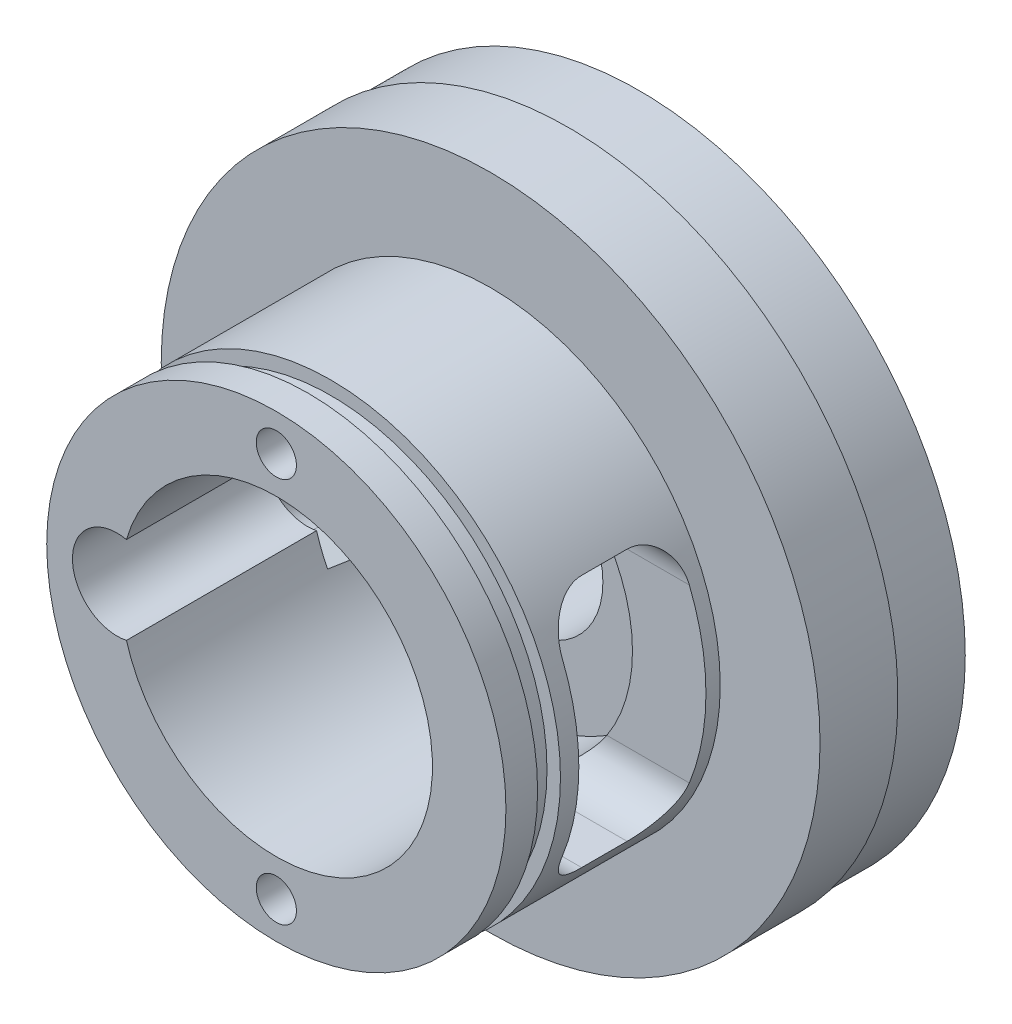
ISO-10303-21;
HEADER;
FILE_DESCRIPTION(('STEP AP214'),'2;1');
FILE_NAME('part.step','',(''),(''),'','','');
FILE_SCHEMA(('AUTOMOTIVE_DESIGN { 1 0 10303 214 1 1 1 1 }'));
ENDSEC;
DATA;
#1=APPLICATION_CONTEXT('core data for automotive mechanical design processes');
#2=APPLICATION_PROTOCOL_DEFINITION('international standard','automotive_design',2000,#1);
#3=PRODUCT_CONTEXT('',#1,'mechanical');
#4=PRODUCT('Part','Part','',(#3));
#5=PRODUCT_RELATED_PRODUCT_CATEGORY('part','',(#4));
#6=PRODUCT_DEFINITION_FORMATION('','',#4);
#7=PRODUCT_DEFINITION_CONTEXT('part definition',#1,'design');
#8=PRODUCT_DEFINITION('design','',#6,#7);
#9=PRODUCT_DEFINITION_SHAPE('','',#8);
#10=(LENGTH_UNIT() NAMED_UNIT(*) SI_UNIT(.MILLI.,.METRE.));
#11=(NAMED_UNIT(*) PLANE_ANGLE_UNIT() SI_UNIT($,.RADIAN.));
#12=(NAMED_UNIT(*) SI_UNIT($,.STERADIAN.) SOLID_ANGLE_UNIT());
#13=UNCERTAINTY_MEASURE_WITH_UNIT(LENGTH_MEASURE(1.E-05),#10,'distance_accuracy_value','');
#14=(GEOMETRIC_REPRESENTATION_CONTEXT(3) GLOBAL_UNCERTAINTY_ASSIGNED_CONTEXT((#13)) GLOBAL_UNIT_ASSIGNED_CONTEXT((#10,
#11,#12)) REPRESENTATION_CONTEXT('',''));
#15=CARTESIAN_POINT('',(0.,0.,0.));
#16=DIRECTION('',(0.,0.,1.));
#17=DIRECTION('',(1.,0.,0.));
#18=AXIS2_PLACEMENT_3D('',#15,#16,#17);
#19=CARTESIAN_POINT('',(-9.906,0.,0.));
#20=DIRECTION('',(0.,0.,1.));
#21=DIRECTION('',(1.,0.,0.));
#22=AXIS2_PLACEMENT_3D('',#19,#20,#21);
#23=CYLINDRICAL_SURFACE('',#22,2.77876);
#24=CARTESIAN_POINT('',(-9.906,0.,16.764));
#25=DIRECTION('',(0.,0.,-1.));
#26=DIRECTION('',(-1.,0.,0.));
#27=AXIS2_PLACEMENT_3D('',#24,#25,#26);
#28=CIRCLE('',#27,2.77876);
#29=CARTESIAN_POINT('',(-12.68476,0.,16.764));
#30=VERTEX_POINT('',#29);
#31=CARTESIAN_POINT('',(-9.32759282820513,2.71789482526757,16.764));
#32=VERTEX_POINT('',#31);
#33=EDGE_CURVE('E184',#30,#32,#28,.T.);
#34=ORIENTED_EDGE('',*,*,#33,.T.);
#35=DIRECTION('',(0.,0.,1.));
#36=VECTOR('',#35,1.);
#37=CARTESIAN_POINT('',(-9.32759282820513,2.71789482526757,14.29766));
#38=LINE('',#37,#36);
#39=CARTESIAN_POINT('',(-9.32759282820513,2.71789482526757,28.59532));
#40=VERTEX_POINT('',#39);
#41=EDGE_CURVE('E197',#40,#32,#38,.F.);
#42=ORIENTED_EDGE('',*,*,#41,.F.);
#43=CARTESIAN_POINT('',(-9.906,0.,28.59532));
#44=DIRECTION('',(0.,0.,1.));
#45=DIRECTION('',(1.,0.,0.));
#46=AXIS2_PLACEMENT_3D('',#43,#44,#45);
#47=CIRCLE('',#46,2.77876);
#48=CARTESIAN_POINT('',(-9.32759282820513,-2.71789482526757,28.59532));
#49=VERTEX_POINT('',#48);
#50=EDGE_CURVE('E208',#40,#49,#47,.T.);
#51=ORIENTED_EDGE('',*,*,#50,.T.);
#52=DIRECTION('',(0.,0.,1.));
#53=VECTOR('',#52,1.);
#54=CARTESIAN_POINT('',(-9.32759282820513,-2.71789482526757,14.29766));
#55=LINE('',#54,#53);
#56=CARTESIAN_POINT('',(-9.32759282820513,-2.71789482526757,16.764));
#57=VERTEX_POINT('',#56);
#58=EDGE_CURVE('E207',#57,#49,#55,.T.);
#59=ORIENTED_EDGE('',*,*,#58,.F.);
#60=EDGE_CURVE('E200',#57,#30,#28,.T.);
#61=ORIENTED_EDGE('',*,*,#60,.T.);
#62=EDGE_LOOP('',(#34,#42,#51,#59,#61));
#63=FACE_BOUND('',#62,.T.);
#64=ADVANCED_FACE('F38',(#63),#23,.F.);
#65=CARTESIAN_POINT('',(0.,0.,28.59532));
#66=DIRECTION('',(0.,0.,-1.));
#67=DIRECTION('',(-1.,0.,0.));
#68=AXIS2_PLACEMENT_3D('',#65,#66,#67);
#69=CYLINDRICAL_SURFACE('',#68,20.4978);
#70=CARTESIAN_POINT('',(0.,0.,15.26032));
#71=DIRECTION('',(0.,0.,1.));
#72=DIRECTION('',(1.,0.,0.));
#73=AXIS2_PLACEMENT_3D('',#70,#71,#72);
#74=CIRCLE('',#73,20.4978);
#75=CARTESIAN_POINT('',(20.4978,0.,15.26032));
#76=VERTEX_POINT('',#75);
#77=EDGE_CURVE('E238',#76,#76,#74,.T.);
#78=ORIENTED_EDGE('',*,*,#77,.F.);
#79=EDGE_LOOP('',(#78));
#80=FACE_BOUND('',#79,.T.);
#81=CARTESIAN_POINT('',(0.,0.,10.414));
#82=DIRECTION('',(0.,0.,-1.));
#83=DIRECTION('',(-1.,0.,0.));
#84=AXIS2_PLACEMENT_3D('',#81,#82,#83);
#85=CIRCLE('',#84,20.4978);
#86=CARTESIAN_POINT('',(-20.4978,0.,10.414));
#87=VERTEX_POINT('',#86);
#88=EDGE_CURVE('E256',#87,#87,#85,.T.);
#89=ORIENTED_EDGE('',*,*,#88,.F.);
#90=EDGE_LOOP('',(#89));
#91=FACE_BOUND('',#90,.T.);
#92=ADVANCED_FACE('F402',(#80,#91),#69,.T.);
#93=CARTESIAN_POINT('',(0.,0.,-58.5562988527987));
#94=DIRECTION('',(0.,0.,1.));
#95=DIRECTION('',(1.,0.,0.));
#96=AXIS2_PLACEMENT_3D('',#93,#94,#95);
#97=CYLINDRICAL_SURFACE('',#96,14.2875);
#98=CARTESIAN_POINT('',(0.,0.,25.20188));
#99=DIRECTION('',(0.,0.,-1.));
#100=DIRECTION('',(-1.,0.,0.));
#101=AXIS2_PLACEMENT_3D('',#98,#99,#100);
#102=CIRCLE('',#101,14.2875);
#103=CARTESIAN_POINT('',(-14.2875,0.,25.20188));
#104=VERTEX_POINT('',#103);
#105=EDGE_CURVE('E219',#104,#104,#102,.T.);
#106=ORIENTED_EDGE('',*,*,#105,.T.);
#107=EDGE_LOOP('',(#106));
#108=FACE_BOUND('',#107,.T.);
#109=CARTESIAN_POINT('',(0.,0.,15.26032));
#110=DIRECTION('',(0.,0.,1.));
#111=DIRECTION('',(1.,0.,0.));
#112=AXIS2_PLACEMENT_3D('',#109,#110,#111);
#113=CIRCLE('',#112,14.2875);
#114=CARTESIAN_POINT('',(14.2875,0.,15.26032));
#115=VERTEX_POINT('',#114);
#116=EDGE_CURVE('E235',#115,#115,#113,.F.);
#117=ORIENTED_EDGE('',*,*,#116,.F.);
#118=EDGE_LOOP('',(#117));
#119=FACE_BOUND('',#118,.T.);
#120=CARTESIAN_POINT('',(0.,0.,16.14932));
#121=DIRECTION('',(0.,0.,-1.));
#122=DIRECTION('',(-1.,0.,0.));
#123=AXIS2_PLACEMENT_3D('',#120,#121,#122);
#124=CIRCLE('',#123,14.2875);
#125=CARTESIAN_POINT('',(13.2544747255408,-5.334,16.14932));
#126=VERTEX_POINT('',#125);
#127=CARTESIAN_POINT('',(13.2544747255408,5.334,16.14932));
#128=VERTEX_POINT('',#127);
#129=EDGE_CURVE('E212',#126,#128,#124,.F.);
#130=ORIENTED_EDGE('',*,*,#129,.F.);
#131=CARTESIAN_POINT('',(13.2544747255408,-5.334,16.14932));
#132=CARTESIAN_POINT('',(13.2228858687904,-5.41250667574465,16.1493233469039));
#133=CARTESIAN_POINT('',(13.1906101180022,-5.4906812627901,16.1529607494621));
#134=CARTESIAN_POINT('',(13.1249338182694,-5.64586992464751,16.1673336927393));
#135=CARTESIAN_POINT('',(13.0915336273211,-5.72288435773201,16.1780669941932));
#136=CARTESIAN_POINT('',(12.9901156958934,-5.95123230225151,16.220606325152));
#137=CARTESIAN_POINT('',(12.9207606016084,-6.10016774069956,16.2627531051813));
#138=CARTESIAN_POINT('',(12.7812086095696,-6.38740222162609,16.3729379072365));
#139=CARTESIAN_POINT('',(12.7110124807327,-6.52571023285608,16.4409538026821));
#140=CARTESIAN_POINT('',(12.5725362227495,-6.78867258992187,16.6014369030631));
#141=CARTESIAN_POINT('',(12.5042577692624,-6.91331525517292,16.6939247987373));
#142=CARTESIAN_POINT('',(12.372384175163,-7.14667455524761,16.9030741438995));
#143=CARTESIAN_POINT('',(12.3088556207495,-7.25518047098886,17.0200142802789));
#144=CARTESIAN_POINT('',(12.1918534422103,-7.45012062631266,17.2753482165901));
#145=CARTESIAN_POINT('',(12.1383637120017,-7.53659030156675,17.4137069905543));
#146=CARTESIAN_POINT('',(12.0579871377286,-7.66432027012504,17.6712876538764));
#147=CARTESIAN_POINT('',(12.0277929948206,-7.71148121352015,17.7865741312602));
#148=CARTESIAN_POINT('',(11.9779313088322,-7.78870670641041,18.024787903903));
#149=CARTESIAN_POINT('',(11.9582412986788,-7.81880775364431,18.1476982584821));
#150=CARTESIAN_POINT('',(11.9371092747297,-7.8510035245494,18.341263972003));
#151=CARTESIAN_POINT('',(11.9314420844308,-7.85960704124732,18.4104494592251));
#152=CARTESIAN_POINT('',(11.9238538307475,-7.87111073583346,18.5495155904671));
#153=CARTESIAN_POINT('',(11.9219338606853,-7.87400924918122,18.6193964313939));
#154=CARTESIAN_POINT('',(11.9219453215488,-7.874,18.68932));
#155=B_SPLINE_CURVE_WITH_KNOTS('',3,(#131,#132,#133,#134,#135,#136,#137,#138,#139,#140,#141,
#142,#143,#144,#145,#146,#147,#148,#149,#150,#151,#152,#153,#154),.UNSPECIFIED.,.F.,.F.,(4,2,2,
2,2,2,2,2,2,2,2,4),(0.,0.253693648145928,0.507307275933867,1.01358523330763,1.51943112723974,
2.02570608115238,2.53810068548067,3.04966605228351,3.43260482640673,3.81472122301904,
4.0242636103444,4.23386712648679),.UNSPECIFIED.);
#156=CARTESIAN_POINT('',(11.9219453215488,-7.874,18.68932));
#157=VERTEX_POINT('',#156);
#158=EDGE_CURVE('E312',#126,#157,#155,.T.);
#159=ORIENTED_EDGE('',*,*,#158,.T.);
#160=DIRECTION('',(0.,0.,1.));
#161=VECTOR('',#160,1.);
#162=CARTESIAN_POINT('',(11.9219453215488,-7.874,-58.5562988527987));
#163=LINE('',#162,#161);
#164=CARTESIAN_POINT('',(11.9219453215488,-7.874,21.51888));
#165=VERTEX_POINT('',#164);
#166=EDGE_CURVE('E378',#157,#165,#163,.T.);
#167=ORIENTED_EDGE('',*,*,#166,.T.);
#168=CARTESIAN_POINT('',(11.9219453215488,-7.874,21.51888));
#169=CARTESIAN_POINT('',(11.9219329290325,-7.87401225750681,21.5827483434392));
#170=CARTESIAN_POINT('',(11.9235359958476,-7.87159143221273,21.64660778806));
#171=CARTESIAN_POINT('',(11.9298789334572,-7.8619784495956,21.7737770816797));
#172=CARTESIAN_POINT('',(11.9346171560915,-7.85478879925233,21.8370872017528));
#173=CARTESIAN_POINT('',(11.9471005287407,-7.83578752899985,21.9623335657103));
#174=CARTESIAN_POINT('',(11.9548282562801,-7.82400268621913,22.0242756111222));
#175=CARTESIAN_POINT('',(11.9731162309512,-7.7959876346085,22.1467062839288));
#176=CARTESIAN_POINT('',(11.9836767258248,-7.77975703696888,22.2071947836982));
#177=CARTESIAN_POINT('',(12.0192612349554,-7.72476108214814,22.3856560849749));
#178=CARTESIAN_POINT('',(12.0482236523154,-7.67963882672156,22.5009632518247));
#179=CARTESIAN_POINT('',(12.1146593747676,-7.57440027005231,22.7218929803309));
#180=CARTESIAN_POINT('',(12.1521441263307,-7.51426379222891,22.8275022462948));
#181=CARTESIAN_POINT('',(12.2366544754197,-7.37590615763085,23.035105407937));
#182=CARTESIAN_POINT('',(12.2841913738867,-7.29665159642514,23.1362005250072));
#183=CARTESIAN_POINT('',(12.3843064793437,-7.125409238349,23.3240479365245));
#184=CARTESIAN_POINT('',(12.4368867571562,-7.03341620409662,23.4107942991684));
#185=CARTESIAN_POINT('',(12.5532914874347,-6.82378033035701,23.5811774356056));
#186=CARTESIAN_POINT('',(12.6176055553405,-6.70436647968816,23.6623084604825));
#187=CARTESIAN_POINT('',(12.7474314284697,-6.45411078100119,23.8030833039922));
#188=CARTESIAN_POINT('',(12.8129434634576,-6.32326672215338,23.8627229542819));
#189=CARTESIAN_POINT('',(12.9431162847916,-6.05235492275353,23.9594312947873));
#190=CARTESIAN_POINT('',(13.0077732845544,-5.91225647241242,23.9964201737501));
#191=CARTESIAN_POINT('',(13.1023561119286,-5.69798764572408,24.0337134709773));
#192=CARTESIAN_POINT('',(13.1335000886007,-5.62583616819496,24.0431130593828));
#193=CARTESIAN_POINT('',(13.1947880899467,-5.48055238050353,24.055695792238));
#194=CARTESIAN_POINT('',(13.2249318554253,-5.40741982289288,24.0588773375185));
#195=CARTESIAN_POINT('',(13.2544747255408,-5.334,24.05888));
#196=B_SPLINE_CURVE_WITH_KNOTS('',3,(#168,#169,#170,#171,#172,#173,#174,#175,#176,#177,#178,
#179,#180,#181,#182,#183,#184,#185,#186,#187,#188,#189,#190,#191,#192,#193,#194,#195),
.UNSPECIFIED.,.F.,.F.,(4,2,2,2,2,2,2,2,2,2,2,2,2,4),(0.,0.191524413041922,0.382948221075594,
0.573272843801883,0.763614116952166,1.14327649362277,1.52345184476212,1.93279032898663,
2.34229761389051,2.81445034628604,3.28669460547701,3.76059341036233,3.99780938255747,
4.23508635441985),.UNSPECIFIED.);
#197=CARTESIAN_POINT('',(13.2544747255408,-5.334,24.05888));
#198=VERTEX_POINT('',#197);
#199=EDGE_CURVE('E280',#165,#198,#196,.T.);
#200=ORIENTED_EDGE('',*,*,#199,.T.);
#201=CARTESIAN_POINT('',(0.,0.,24.05888));
#202=DIRECTION('',(0.,0.,1.));
#203=DIRECTION('',(1.,0.,0.));
#204=AXIS2_PLACEMENT_3D('',#201,#202,#203);
#205=CIRCLE('',#204,14.2875);
#206=CARTESIAN_POINT('',(13.2544747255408,5.334,24.05888));
#207=VERTEX_POINT('',#206);
#208=EDGE_CURVE('E374',#207,#198,#205,.F.);
#209=ORIENTED_EDGE('',*,*,#208,.F.);
#210=CARTESIAN_POINT('',(13.2544747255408,5.334,24.05888));
#211=CARTESIAN_POINT('',(13.2228858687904,5.41250667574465,24.0588766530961));
#212=CARTESIAN_POINT('',(13.1906101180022,5.4906812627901,24.0552392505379));
#213=CARTESIAN_POINT('',(13.1249338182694,5.64586992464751,24.0408663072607));
#214=CARTESIAN_POINT('',(13.0915336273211,5.72288435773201,24.0301330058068));
#215=CARTESIAN_POINT('',(12.9901156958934,5.95123230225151,23.987593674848));
#216=CARTESIAN_POINT('',(12.9207606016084,6.10016774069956,23.9454468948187));
#217=CARTESIAN_POINT('',(12.7812086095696,6.38740222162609,23.8352620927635));
#218=CARTESIAN_POINT('',(12.7110124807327,6.52571023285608,23.7672461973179));
#219=CARTESIAN_POINT('',(12.5725362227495,6.78867258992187,23.6067630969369));
#220=CARTESIAN_POINT('',(12.5042577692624,6.91331525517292,23.5142752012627));
#221=CARTESIAN_POINT('',(12.372384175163,7.14667455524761,23.3051258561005));
#222=CARTESIAN_POINT('',(12.3088556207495,7.25518047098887,23.1881857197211));
#223=CARTESIAN_POINT('',(12.1918534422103,7.45012062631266,22.9328517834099));
#224=CARTESIAN_POINT('',(12.1383637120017,7.53659030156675,22.7944930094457));
#225=CARTESIAN_POINT('',(12.0579871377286,7.66432027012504,22.5369123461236));
#226=CARTESIAN_POINT('',(12.0277929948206,7.71148121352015,22.4216258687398));
#227=CARTESIAN_POINT('',(11.9779313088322,7.78870670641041,22.183412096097));
#228=CARTESIAN_POINT('',(11.9582412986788,7.81880775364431,22.0605017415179));
#229=CARTESIAN_POINT('',(11.9371092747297,7.8510035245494,21.866936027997));
#230=CARTESIAN_POINT('',(11.9314420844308,7.85960704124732,21.7977505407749));
#231=CARTESIAN_POINT('',(11.9238538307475,7.87111073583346,21.6586844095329));
#232=CARTESIAN_POINT('',(11.9219338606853,7.87400924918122,21.5888035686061));
#233=CARTESIAN_POINT('',(11.9219453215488,7.874,21.51888));
#234=B_SPLINE_CURVE_WITH_KNOTS('',3,(#210,#211,#212,#213,#214,#215,#216,#217,#218,#219,#220,
#221,#222,#223,#224,#225,#226,#227,#228,#229,#230,#231,#232,#233),.UNSPECIFIED.,.F.,.F.,(4,2,2,
2,2,2,2,2,2,2,2,4),(0.,0.253693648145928,0.507307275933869,1.01358523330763,1.51943112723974,
2.02570608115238,2.53810068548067,3.04966605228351,3.43260482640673,3.81472122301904,
4.0242636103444,4.23386712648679),.UNSPECIFIED.);
#235=CARTESIAN_POINT('',(11.9219453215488,7.874,21.51888));
#236=VERTEX_POINT('',#235);
#237=EDGE_CURVE('E317',#207,#236,#234,.T.);
#238=ORIENTED_EDGE('',*,*,#237,.T.);
#239=DIRECTION('',(0.,0.,1.));
#240=VECTOR('',#239,1.);
#241=CARTESIAN_POINT('',(11.9219453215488,7.874,-58.5562988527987));
#242=LINE('',#241,#240);
#243=CARTESIAN_POINT('',(11.9219453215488,7.874,18.68932));
#244=VERTEX_POINT('',#243);
#245=EDGE_CURVE('E259',#244,#236,#242,.T.);
#246=ORIENTED_EDGE('',*,*,#245,.F.);
#247=CARTESIAN_POINT('',(11.9219453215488,7.874,18.68932));
#248=CARTESIAN_POINT('',(11.9219329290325,7.87401225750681,18.6254516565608));
#249=CARTESIAN_POINT('',(11.9235359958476,7.87159143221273,18.56159221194));
#250=CARTESIAN_POINT('',(11.9298789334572,7.8619784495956,18.4344229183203));
#251=CARTESIAN_POINT('',(11.9346171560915,7.85478879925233,18.3711127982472));
#252=CARTESIAN_POINT('',(11.9471005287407,7.83578752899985,18.2458664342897));
#253=CARTESIAN_POINT('',(11.9548282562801,7.82400268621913,18.1839243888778));
#254=CARTESIAN_POINT('',(11.9731162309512,7.7959876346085,18.0614937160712));
#255=CARTESIAN_POINT('',(11.9836767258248,7.77975703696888,18.0010052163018));
#256=CARTESIAN_POINT('',(12.0192612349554,7.72476108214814,17.8225439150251));
#257=CARTESIAN_POINT('',(12.0482236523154,7.67963882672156,17.7072367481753));
#258=CARTESIAN_POINT('',(12.1146593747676,7.57440027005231,17.4863070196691));
#259=CARTESIAN_POINT('',(12.1521441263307,7.51426379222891,17.3806977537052));
#260=CARTESIAN_POINT('',(12.2366544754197,7.37590615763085,17.173094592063));
#261=CARTESIAN_POINT('',(12.2841913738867,7.29665159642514,17.0719994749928));
#262=CARTESIAN_POINT('',(12.3843064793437,7.125409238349,16.8841520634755));
#263=CARTESIAN_POINT('',(12.4368867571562,7.03341620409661,16.7974057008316));
#264=CARTESIAN_POINT('',(12.5532914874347,6.82378033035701,16.6270225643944));
#265=CARTESIAN_POINT('',(12.6176055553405,6.70436647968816,16.5458915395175));
#266=CARTESIAN_POINT('',(12.7474314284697,6.45411078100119,16.4051166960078));
#267=CARTESIAN_POINT('',(12.8129434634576,6.32326672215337,16.3454770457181));
#268=CARTESIAN_POINT('',(12.9431162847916,6.05235492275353,16.2487687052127));
#269=CARTESIAN_POINT('',(13.0077732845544,5.91225647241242,16.2117798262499));
#270=CARTESIAN_POINT('',(13.1023561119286,5.69798764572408,16.1744865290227));
#271=CARTESIAN_POINT('',(13.1335000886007,5.62583616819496,16.1650869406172));
#272=CARTESIAN_POINT('',(13.1947880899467,5.48055238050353,16.152504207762));
#273=CARTESIAN_POINT('',(13.2249318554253,5.40741982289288,16.1493226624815));
#274=CARTESIAN_POINT('',(13.2544747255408,5.334,16.14932));
#275=B_SPLINE_CURVE_WITH_KNOTS('',3,(#247,#248,#249,#250,#251,#252,#253,#254,#255,#256,#257,
#258,#259,#260,#261,#262,#263,#264,#265,#266,#267,#268,#269,#270,#271,#272,#273,#274),
.UNSPECIFIED.,.F.,.F.,(4,2,2,2,2,2,2,2,2,2,2,2,2,4),(0.,0.191524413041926,0.382948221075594,
0.573272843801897,0.763614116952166,1.14327649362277,1.52345184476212,1.93279032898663,
2.34229761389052,2.81445034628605,3.28669460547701,3.76059341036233,3.99780938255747,
4.23508635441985),.UNSPECIFIED.);
#276=EDGE_CURVE('E13',#244,#128,#275,.T.);
#277=ORIENTED_EDGE('',*,*,#276,.T.);
#278=EDGE_LOOP('',(#130,#159,#167,#200,#209,#238,#246,#277));
#279=FACE_BOUND('',#278,.T.);
#280=ADVANCED_FACE('F305',(#108,#119,#279),#97,.T.);
#281=CARTESIAN_POINT('',(0.,0.,13.35532));
#282=DIRECTION('',(0.,0.,1.));
#283=DIRECTION('',(1.,0.,0.));
#284=AXIS2_PLACEMENT_3D('',#281,#282,#283);
#285=CYLINDRICAL_SURFACE('',#284,9.7155);
#286=CARTESIAN_POINT('',(0.,0.,16.764));
#287=DIRECTION('',(0.,0.,-1.));
#288=DIRECTION('',(-1.,0.,0.));
#289=AXIS2_PLACEMENT_3D('',#286,#287,#288);
#290=CIRCLE('',#289,9.7155);
#291=CARTESIAN_POINT('',(-8.63903439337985,4.445,16.764));
#292=VERTEX_POINT('',#291);
#293=EDGE_CURVE('E181',#32,#292,#290,.T.);
#294=ORIENTED_EDGE('',*,*,#293,.T.);
#295=CARTESIAN_POINT('',(0.,0.,59.0553499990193));
#296=DIRECTION('',(0.,0.994521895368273,0.104528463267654));
#297=DIRECTION('',(0.,-0.104528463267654,0.994521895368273));
#298=AXIS2_PLACEMENT_3D('',#295,#296,#297);
#299=ELLIPSE('',#298,92.9459756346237,9.7155);
#300=CARTESIAN_POINT('',(-8.44509142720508,4.80326670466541,13.35532));
#301=VERTEX_POINT('',#300);
#302=EDGE_CURVE('E647',#301,#292,#299,.T.);
#303=ORIENTED_EDGE('',*,*,#302,.F.);
#304=CARTESIAN_POINT('',(0.,0.,13.35532));
#305=DIRECTION('',(0.,0.,1.));
#306=DIRECTION('',(1.,0.,0.));
#307=AXIS2_PLACEMENT_3D('',#304,#305,#306);
#308=CIRCLE('',#307,9.7155);
#309=CARTESIAN_POINT('',(-8.44509142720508,-4.8032667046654,13.35532));
#310=VERTEX_POINT('',#309);
#311=EDGE_CURVE('E216',#310,#301,#308,.T.);
#312=ORIENTED_EDGE('',*,*,#311,.F.);
#313=CARTESIAN_POINT('',(0.,0.,59.0553499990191));
#314=DIRECTION('',(0.,-0.994521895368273,0.104528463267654));
#315=DIRECTION('',(0.,0.104528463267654,0.994521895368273));
#316=AXIS2_PLACEMENT_3D('',#313,#314,#315);
#317=ELLIPSE('',#316,92.9459756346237,9.7155);
#318=CARTESIAN_POINT('',(-8.63903439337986,-4.44499999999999,16.764));
#319=VERTEX_POINT('',#318);
#320=EDGE_CURVE('E648',#319,#310,#317,.T.);
#321=ORIENTED_EDGE('',*,*,#320,.F.);
#322=EDGE_CURVE('E193',#319,#57,#290,.T.);
#323=ORIENTED_EDGE('',*,*,#322,.T.);
#324=ORIENTED_EDGE('',*,*,#58,.T.);
#325=CARTESIAN_POINT('',(0.,0.,28.59532));
#326=DIRECTION('',(0.,0.,1.));
#327=DIRECTION('',(1.,0.,0.));
#328=AXIS2_PLACEMENT_3D('',#325,#326,#327);
#329=CIRCLE('',#328,9.7155);
#330=EDGE_CURVE('E206',#49,#40,#329,.T.);
#331=ORIENTED_EDGE('',*,*,#330,.T.);
#332=ORIENTED_EDGE('',*,*,#41,.T.);
#333=EDGE_LOOP('',(#294,#303,#312,#321,#323,#324,#331,#332));
#334=FACE_BOUND('',#333,.T.);
#335=DIRECTION('',(0.,0.,1.));
#336=VECTOR('',#335,1.);
#337=CARTESIAN_POINT('',(5.6913148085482,-7.874,13.35532));
#338=LINE('',#337,#336);
#339=CARTESIAN_POINT('',(5.6913148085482,-7.874,18.68932));
#340=VERTEX_POINT('',#339);
#341=CARTESIAN_POINT('',(5.6913148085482,-7.874,21.51888));
#342=VERTEX_POINT('',#341);
#343=EDGE_CURVE('E252',#340,#342,#338,.T.);
#344=ORIENTED_EDGE('',*,*,#343,.F.);
#345=CARTESIAN_POINT('',(5.6913148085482,-7.874,18.68932));
#346=CARTESIAN_POINT('',(5.69129715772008,-7.87400951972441,18.6440920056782));
#347=CARTESIAN_POINT('',(5.69298559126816,-7.87279230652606,18.598875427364));
#348=CARTESIAN_POINT('',(5.69963789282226,-7.86797931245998,18.5088621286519));
#349=CARTESIAN_POINT('',(5.70459798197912,-7.86438627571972,18.4640649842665));
#350=CARTESIAN_POINT('',(5.71758534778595,-7.85494860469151,18.3756723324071));
#351=CARTESIAN_POINT('',(5.72557815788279,-7.84912926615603,18.3320690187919));
#352=CARTESIAN_POINT('',(5.74440220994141,-7.83536343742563,18.2458207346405));
#353=CARTESIAN_POINT('',(5.75523442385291,-7.827416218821,18.2031760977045));
#354=CARTESIAN_POINT('',(5.79797598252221,-7.79588740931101,18.0549141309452));
#355=CARTESIAN_POINT('',(5.83684974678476,-7.7669359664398,17.9523633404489));
#356=CARTESIAN_POINT('',(5.92661672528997,-7.69865867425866,17.7561010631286));
#357=CARTESIAN_POINT('',(5.97756928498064,-7.65928148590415,17.6624365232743));
#358=CARTESIAN_POINT('',(6.11600780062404,-7.54961080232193,17.4381914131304));
#359=CARTESIAN_POINT('',(6.2087614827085,-7.47385926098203,17.3135643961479));
#360=CARTESIAN_POINT('',(6.40406007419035,-7.30722641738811,17.0836453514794));
#361=CARTESIAN_POINT('',(6.50662521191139,-7.21631355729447,16.9783946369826));
#362=CARTESIAN_POINT('',(6.68179227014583,-7.05364038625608,16.8177342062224));
#363=CARTESIAN_POINT('',(6.75315671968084,-6.98541246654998,16.7573159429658));
#364=CARTESIAN_POINT('',(6.89688886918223,-6.84354325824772,16.6445466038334));
#365=CARTESIAN_POINT('',(6.96925689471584,-6.76990017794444,16.5921982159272));
#366=CARTESIAN_POINT('',(7.18624052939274,-6.54161440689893,16.447510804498));
#367=CARTESIAN_POINT('',(7.33109933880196,-6.37928284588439,16.3672046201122));
#368=CARTESIAN_POINT('',(7.58619924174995,-6.07222260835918,16.2546591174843));
#369=CARTESIAN_POINT('',(7.69745979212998,-5.93068652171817,16.2159474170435));
#370=CARTESIAN_POINT('',(7.85981497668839,-5.71161430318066,16.1764488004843));
#371=CARTESIAN_POINT('',(7.91321409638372,-5.63740656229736,16.166376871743));
#372=CARTESIAN_POINT('',(8.01820467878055,-5.48705553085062,16.1528123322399));
#373=CARTESIAN_POINT('',(8.06979474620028,-5.41091082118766,16.1493246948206));
#374=CARTESIAN_POINT('',(8.12030690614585,-5.334,16.14932));
#375=B_SPLINE_CURVE_WITH_KNOTS('',3,(#345,#346,#347,#348,#349,#350,#351,#352,#353,#354,#355,
#356,#357,#358,#359,#360,#361,#362,#363,#364,#365,#366,#367,#368,#369,#370,#371,#372,#373,#374),
.UNSPECIFIED.,.F.,.F.,(4,2,2,2,2,2,2,2,2,2,2,2,2,2,4),(0.,0.135617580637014,0.271078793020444,
0.405044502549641,0.53905612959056,0.877284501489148,1.21721041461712,1.73289866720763,
2.24967402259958,2.59651823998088,2.94347773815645,3.63564738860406,4.18621681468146,
4.46189723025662,4.73778579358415),.UNSPECIFIED.);
#376=CARTESIAN_POINT('',(8.12030690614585,-5.334,16.14932));
#377=VERTEX_POINT('',#376);
#378=EDGE_CURVE('E337',#340,#377,#375,.T.);
#379=ORIENTED_EDGE('',*,*,#378,.T.);
#380=CARTESIAN_POINT('',(0.,0.,16.14932));
#381=DIRECTION('',(0.,0.,-1.));
#382=DIRECTION('',(-1.,0.,0.));
#383=AXIS2_PLACEMENT_3D('',#380,#381,#382);
#384=CIRCLE('',#383,9.7155);
#385=CARTESIAN_POINT('',(8.12030690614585,5.334,16.14932));
#386=VERTEX_POINT('',#385);
#387=EDGE_CURVE('E249',#377,#386,#384,.F.);
#388=ORIENTED_EDGE('',*,*,#387,.T.);
#389=CARTESIAN_POINT('',(8.12030690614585,5.334,16.14932));
#390=CARTESIAN_POINT('',(8.06088450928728,5.42449211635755,16.1493281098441));
#391=CARTESIAN_POINT('',(7.99995513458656,5.51392458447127,16.1541544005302));
#392=CARTESIAN_POINT('',(7.87567351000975,5.69001116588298,16.1728350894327));
#393=CARTESIAN_POINT('',(7.81232350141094,5.77666771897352,16.1866813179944));
#394=CARTESIAN_POINT('',(7.68380588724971,5.94654578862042,16.2227611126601));
#395=CARTESIAN_POINT('',(7.61864200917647,6.02977358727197,16.2449785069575));
#396=CARTESIAN_POINT('',(7.48693265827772,6.19255740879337,16.2972935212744));
#397=CARTESIAN_POINT('',(7.42038687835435,6.2721126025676,16.327392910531));
#398=CARTESIAN_POINT('',(7.22249267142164,6.50126696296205,16.4273621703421));
#399=CARTESIAN_POINT('',(7.08983348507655,6.64535386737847,16.5077943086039));
#400=CARTESIAN_POINT('',(6.8919827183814,6.8483970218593,16.6484891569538));
#401=CARTESIAN_POINT('',(6.82617169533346,6.9139424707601,16.6987751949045));
#402=CARTESIAN_POINT('',(6.6956306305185,7.0404340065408,16.8060902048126));
#403=CARTESIAN_POINT('',(6.63090034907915,7.10138112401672,16.8631176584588));
#404=CARTESIAN_POINT('',(6.47042329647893,7.2485683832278,17.0152989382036));
#405=CARTESIAN_POINT('',(6.37592461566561,7.33161351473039,17.1149317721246));
#406=CARTESIAN_POINT('',(6.19582465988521,7.48442108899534,17.331096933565));
#407=CARTESIAN_POINT('',(6.11021000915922,7.55420363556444,17.4476032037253));
#408=CARTESIAN_POINT('',(5.98007051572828,7.65730013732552,17.6583711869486));
#409=CARTESIAN_POINT('',(5.93119162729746,7.69512164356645,17.747715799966));
#410=CARTESIAN_POINT('',(5.84434223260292,7.76128684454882,17.9345914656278));
#411=CARTESIAN_POINT('',(5.80632420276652,7.78967192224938,18.0320843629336));
#412=CARTESIAN_POINT('',(5.76227799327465,7.82223572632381,18.1771334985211));
#413=CARTESIAN_POINT('',(5.75029010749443,7.83104540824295,18.2219016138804));
#414=CARTESIAN_POINT('',(5.72942955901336,7.8463203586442,18.3125496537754));
#415=CARTESIAN_POINT('',(5.72055583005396,7.85278642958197,18.3584291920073));
#416=CARTESIAN_POINT('',(5.70611692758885,7.86328530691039,18.4515527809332));
#417=CARTESIAN_POINT('',(5.70059243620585,7.867288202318,18.4988065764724));
#418=CARTESIAN_POINT('',(5.69317802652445,7.87265320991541,18.5938083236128));
#419=CARTESIAN_POINT('',(5.69129294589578,7.87401180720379,18.6415568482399));
#420=CARTESIAN_POINT('',(5.6913148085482,7.874,18.68932));
#421=B_SPLINE_CURVE_WITH_KNOTS('',3,(#389,#390,#391,#392,#393,#394,#395,#396,#397,#398,#399,
#400,#401,#402,#403,#404,#405,#406,#407,#408,#409,#410,#411,#412,#413,#414,#415,#416,#417,#418,
#419,#420),.UNSPECIFIED.,.F.,.F.,(4,2,2,2,2,2,2,2,2,2,2,2,2,2,2,4),(0.,0.324565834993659,
0.648838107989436,0.9724871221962,1.29620884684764,1.92848270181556,2.24510956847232,
2.56166525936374,3.04172076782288,3.52104268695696,3.84602284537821,4.16955841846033,
4.31094218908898,4.45227750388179,4.59529686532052,4.7385062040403),.UNSPECIFIED.);
#422=CARTESIAN_POINT('',(5.6913148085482,7.874,18.68932));
#423=VERTEX_POINT('',#422);
#424=EDGE_CURVE('E48',#386,#423,#421,.T.);
#425=ORIENTED_EDGE('',*,*,#424,.T.);
#426=DIRECTION('',(0.,0.,1.));
#427=VECTOR('',#426,1.);
#428=CARTESIAN_POINT('',(5.6913148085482,7.874,13.35532));
#429=LINE('',#428,#427);
#430=CARTESIAN_POINT('',(5.6913148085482,7.874,21.51888));
#431=VERTEX_POINT('',#430);
#432=EDGE_CURVE('E241',#423,#431,#429,.T.);
#433=ORIENTED_EDGE('',*,*,#432,.T.);
#434=CARTESIAN_POINT('',(5.6913148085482,7.874,21.51888));
#435=CARTESIAN_POINT('',(5.69129715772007,7.87400951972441,21.5641079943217));
#436=CARTESIAN_POINT('',(5.69298559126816,7.87279230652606,21.609324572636));
#437=CARTESIAN_POINT('',(5.69963789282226,7.86797931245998,21.6993378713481));
#438=CARTESIAN_POINT('',(5.70459798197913,7.86438627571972,21.7441350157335));
#439=CARTESIAN_POINT('',(5.71758534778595,7.8549486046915,21.8325276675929));
#440=CARTESIAN_POINT('',(5.72557815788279,7.84912926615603,21.8761309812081));
#441=CARTESIAN_POINT('',(5.74440220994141,7.83536343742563,21.9623792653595));
#442=CARTESIAN_POINT('',(5.75523442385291,7.827416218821,22.0050239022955));
#443=CARTESIAN_POINT('',(5.79797598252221,7.79588740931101,22.1532858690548));
#444=CARTESIAN_POINT('',(5.83684974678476,7.7669359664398,22.2558366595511));
#445=CARTESIAN_POINT('',(5.92661672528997,7.69865867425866,22.4520989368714));
#446=CARTESIAN_POINT('',(5.97756928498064,7.65928148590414,22.5457634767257));
#447=CARTESIAN_POINT('',(6.11600780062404,7.54961080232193,22.7700085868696));
#448=CARTESIAN_POINT('',(6.20876148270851,7.47385926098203,22.8946356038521));
#449=CARTESIAN_POINT('',(6.40406007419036,7.30722641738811,23.1245546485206));
#450=CARTESIAN_POINT('',(6.50662521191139,7.21631355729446,23.2298053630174));
#451=CARTESIAN_POINT('',(6.68179227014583,7.05364038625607,23.3904657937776));
#452=CARTESIAN_POINT('',(6.75315671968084,6.98541246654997,23.4508840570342));
#453=CARTESIAN_POINT('',(6.89688886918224,6.84354325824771,23.5636533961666));
#454=CARTESIAN_POINT('',(6.96925689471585,6.76990017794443,23.6160017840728));
#455=CARTESIAN_POINT('',(7.18624052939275,6.54161440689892,23.760689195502));
#456=CARTESIAN_POINT('',(7.33109933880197,6.37928284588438,23.8409953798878));
#457=CARTESIAN_POINT('',(7.58619924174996,6.07222260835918,23.9535408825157));
#458=CARTESIAN_POINT('',(7.69745979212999,5.93068652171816,23.9922525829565));
#459=CARTESIAN_POINT('',(7.85981497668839,5.71161430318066,24.0317511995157));
#460=CARTESIAN_POINT('',(7.91321409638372,5.63740656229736,24.041823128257));
#461=CARTESIAN_POINT('',(8.01820467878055,5.48705553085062,24.0553876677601));
#462=CARTESIAN_POINT('',(8.06979474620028,5.41091082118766,24.0588753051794));
#463=CARTESIAN_POINT('',(8.12030690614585,5.334,24.05888));
#464=B_SPLINE_CURVE_WITH_KNOTS('',3,(#434,#435,#436,#437,#438,#439,#440,#441,#442,#443,#444,
#445,#446,#447,#448,#449,#450,#451,#452,#453,#454,#455,#456,#457,#458,#459,#460,#461,#462,#463),
.UNSPECIFIED.,.F.,.F.,(4,2,2,2,2,2,2,2,2,2,2,2,2,2,4),(0.,0.135617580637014,0.271078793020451,
0.405044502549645,0.539056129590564,0.877284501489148,1.21721041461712,1.73289866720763,
2.24967402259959,2.5965182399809,2.94347773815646,3.63564738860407,4.18621681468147,
4.46189723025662,4.73778579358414),.UNSPECIFIED.);
#465=CARTESIAN_POINT('',(8.12030690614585,5.334,24.05888));
#466=VERTEX_POINT('',#465);
#467=EDGE_CURVE('E322',#431,#466,#464,.T.);
#468=ORIENTED_EDGE('',*,*,#467,.T.);
#469=CARTESIAN_POINT('',(0.,0.,24.05888));
#470=DIRECTION('',(0.,0.,1.));
#471=DIRECTION('',(1.,0.,0.));
#472=AXIS2_PLACEMENT_3D('',#469,#470,#471);
#473=CIRCLE('',#472,9.7155);
#474=CARTESIAN_POINT('',(8.12030690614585,-5.334,24.05888));
#475=VERTEX_POINT('',#474);
#476=EDGE_CURVE('E246',#466,#475,#473,.F.);
#477=ORIENTED_EDGE('',*,*,#476,.T.);
#478=CARTESIAN_POINT('',(8.12030690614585,-5.334,24.05888));
#479=CARTESIAN_POINT('',(8.06088450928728,-5.42449211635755,24.0588718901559));
#480=CARTESIAN_POINT('',(7.99995513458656,-5.51392458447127,24.0540455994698));
#481=CARTESIAN_POINT('',(7.87567351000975,-5.69001116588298,24.0353649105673));
#482=CARTESIAN_POINT('',(7.81232350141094,-5.77666771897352,24.0215186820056));
#483=CARTESIAN_POINT('',(7.68380588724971,-5.94654578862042,23.9854388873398));
#484=CARTESIAN_POINT('',(7.61864200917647,-6.02977358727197,23.9632214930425));
#485=CARTESIAN_POINT('',(7.48693265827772,-6.19255740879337,23.9109064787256));
#486=CARTESIAN_POINT('',(7.42038687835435,-6.2721126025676,23.880807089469));
#487=CARTESIAN_POINT('',(7.22249267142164,-6.50126696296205,23.7808378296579));
#488=CARTESIAN_POINT('',(7.08983348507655,-6.64535386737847,23.7004056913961));
#489=CARTESIAN_POINT('',(6.8919827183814,-6.8483970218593,23.5597108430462));
#490=CARTESIAN_POINT('',(6.82617169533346,-6.9139424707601,23.5094248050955));
#491=CARTESIAN_POINT('',(6.6956306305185,-7.0404340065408,23.4021097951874));
#492=CARTESIAN_POINT('',(6.63090034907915,-7.10138112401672,23.3450823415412));
#493=CARTESIAN_POINT('',(6.47042329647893,-7.2485683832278,23.1929010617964));
#494=CARTESIAN_POINT('',(6.3759246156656,-7.33161351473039,23.0932682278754));
#495=CARTESIAN_POINT('',(6.19582465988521,-7.48442108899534,22.877103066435));
#496=CARTESIAN_POINT('',(6.11021000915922,-7.55420363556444,22.7605967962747));
#497=CARTESIAN_POINT('',(5.98007051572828,-7.65730013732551,22.5498288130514));
#498=CARTESIAN_POINT('',(5.93119162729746,-7.69512164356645,22.460484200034));
#499=CARTESIAN_POINT('',(5.84434223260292,-7.76128684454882,22.2736085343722));
#500=CARTESIAN_POINT('',(5.80632420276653,-7.78967192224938,22.1761156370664));
#501=CARTESIAN_POINT('',(5.76227799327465,-7.82223572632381,22.0310665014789));
#502=CARTESIAN_POINT('',(5.75029010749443,-7.83104540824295,21.9862983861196));
#503=CARTESIAN_POINT('',(5.72942955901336,-7.8463203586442,21.8956503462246));
#504=CARTESIAN_POINT('',(5.72055583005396,-7.85278642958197,21.8497708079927));
#505=CARTESIAN_POINT('',(5.70611692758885,-7.86328530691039,21.7566472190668));
#506=CARTESIAN_POINT('',(5.70059243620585,-7.867288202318,21.7093934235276));
#507=CARTESIAN_POINT('',(5.69317802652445,-7.87265320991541,21.6143916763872));
#508=CARTESIAN_POINT('',(5.69129294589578,-7.87401180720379,21.5666431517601));
#509=CARTESIAN_POINT('',(5.6913148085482,-7.874,21.51888));
#510=B_SPLINE_CURVE_WITH_KNOTS('',3,(#478,#479,#480,#481,#482,#483,#484,#485,#486,#487,#488,
#489,#490,#491,#492,#493,#494,#495,#496,#497,#498,#499,#500,#501,#502,#503,#504,#505,#506,#507,
#508,#509),.UNSPECIFIED.,.F.,.F.,(4,2,2,2,2,2,2,2,2,2,2,2,2,2,2,4),(0.,0.32456583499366,
0.648838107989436,0.9724871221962,1.29620884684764,1.92848270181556,2.24510956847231,
2.56166525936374,3.04172076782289,3.52104268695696,3.84602284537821,4.16955841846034,
4.31094218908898,4.45227750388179,4.59529686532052,4.7385062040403),.UNSPECIFIED.);
#511=EDGE_CURVE('E287',#475,#342,#510,.T.);
#512=ORIENTED_EDGE('',*,*,#511,.T.);
#513=EDGE_LOOP('',(#344,#379,#388,#425,#433,#468,#477,#512));
#514=FACE_BOUND('',#513,.T.);
#515=ADVANCED_FACE('F203',(#334,#514),#285,.F.);
#516=CARTESIAN_POINT('',(0.,0.,15.26032));
#517=DIRECTION('',(0.,0.,1.));
#518=DIRECTION('',(1.,0.,0.));
#519=AXIS2_PLACEMENT_3D('',#516,#517,#518);
#520=PLANE('',#519);
#521=ORIENTED_EDGE('',*,*,#116,.T.);
#522=EDGE_LOOP('',(#521));
#523=FACE_BOUND('',#522,.T.);
#524=ORIENTED_EDGE('',*,*,#77,.T.);
#525=EDGE_LOOP('',(#524));
#526=FACE_BOUND('',#525,.T.);
#527=ADVANCED_FACE('F306',(#523,#526),#520,.T.);
#528=CARTESIAN_POINT('',(14.2875,0.,26.62428));
#529=DIRECTION('',(0.,0.,-1.));
#530=DIRECTION('',(-1.,0.,0.));
#531=AXIS2_PLACEMENT_3D('',#528,#529,#530);
#532=PLANE('',#531);
#533=CARTESIAN_POINT('',(0.,0.,26.62428));
#534=DIRECTION('',(0.,0.,-1.));
#535=DIRECTION('',(-1.,0.,0.));
#536=AXIS2_PLACEMENT_3D('',#533,#534,#535);
#537=CIRCLE('',#536,14.2875);
#538=CARTESIAN_POINT('',(14.2875,0.,26.62428));
#539=VERTEX_POINT('',#538);
#540=EDGE_CURVE('E229',#539,#539,#537,.T.);
#541=ORIENTED_EDGE('',*,*,#540,.T.);
#542=EDGE_LOOP('',(#541));
#543=FACE_BOUND('',#542,.T.);
#544=CARTESIAN_POINT('',(0.,0.,26.62428));
#545=DIRECTION('',(0.,0.,-1.));
#546=DIRECTION('',(-1.,0.,0.));
#547=AXIS2_PLACEMENT_3D('',#544,#545,#546);
#548=CIRCLE('',#547,13.4493);
#549=CARTESIAN_POINT('',(-13.4493,0.,26.62428));
#550=VERTEX_POINT('',#549);
#551=EDGE_CURVE('E226',#550,#550,#548,.T.);
#552=ORIENTED_EDGE('',*,*,#551,.F.);
#553=EDGE_LOOP('',(#552));
#554=FACE_BOUND('',#553,.T.);
#555=ADVANCED_FACE('F687',(#543,#554),#532,.T.);
#556=CARTESIAN_POINT('',(0.,0.,0.));
#557=DIRECTION('',(0.,0.,-1.));
#558=DIRECTION('',(-1.,0.,0.));
#559=AXIS2_PLACEMENT_3D('',#556,#557,#558);
#560=CYLINDRICAL_SURFACE('',#559,13.4493);
#561=ORIENTED_EDGE('',*,*,#551,.T.);
#562=EDGE_LOOP('',(#561));
#563=FACE_BOUND('',#562,.T.);
#564=CARTESIAN_POINT('',(0.,0.,25.20188));
#565=DIRECTION('',(0.,0.,-1.));
#566=DIRECTION('',(-1.,0.,0.));
#567=AXIS2_PLACEMENT_3D('',#564,#565,#566);
#568=CIRCLE('',#567,13.4493);
#569=CARTESIAN_POINT('',(-13.4493,0.,25.20188));
#570=VERTEX_POINT('',#569);
#571=EDGE_CURVE('E223',#570,#570,#568,.T.);
#572=ORIENTED_EDGE('',*,*,#571,.F.);
#573=EDGE_LOOP('',(#572));
#574=FACE_BOUND('',#573,.T.);
#575=ADVANCED_FACE('F690',(#563,#574),#560,.T.);
#576=CARTESIAN_POINT('',(14.2875,0.,25.20188));
#577=DIRECTION('',(0.,0.,1.));
#578=DIRECTION('',(1.,0.,0.));
#579=AXIS2_PLACEMENT_3D('',#576,#577,#578);
#580=PLANE('',#579);
#581=ORIENTED_EDGE('',*,*,#571,.T.);
#582=EDGE_LOOP('',(#581));
#583=FACE_BOUND('',#582,.T.);
#584=ORIENTED_EDGE('',*,*,#105,.F.);
#585=EDGE_LOOP('',(#584));
#586=FACE_BOUND('',#585,.T.);
#587=ADVANCED_FACE('F346',(#583,#586),#580,.T.);
#588=CARTESIAN_POINT('',(0.,0.,28.59532));
#589=DIRECTION('',(0.,0.,1.));
#590=DIRECTION('',(1.,0.,0.));
#591=AXIS2_PLACEMENT_3D('',#588,#589,#590);
#592=PLANE('',#591);
#593=CARTESIAN_POINT('',(0.,12.0015,28.59532));
#594=DIRECTION('',(0.,0.,1.));
#595=DIRECTION('',(1.,0.,0.));
#596=AXIS2_PLACEMENT_3D('',#593,#594,#595);
#597=CIRCLE('',#596,1.25);
#598=CARTESIAN_POINT('',(1.25,12.0015,28.59532));
#599=VERTEX_POINT('',#598);
#600=EDGE_CURVE('E428',#599,#599,#597,.T.);
#601=ORIENTED_EDGE('',*,*,#600,.F.);
#602=EDGE_LOOP('',(#601));
#603=FACE_BOUND('',#602,.T.);
#604=CARTESIAN_POINT('',(0.,-12.0015,28.59532));
#605=DIRECTION('',(0.,0.,1.));
#606=DIRECTION('',(1.,0.,0.));
#607=AXIS2_PLACEMENT_3D('',#604,#605,#606);
#608=CIRCLE('',#607,1.25);
#609=CARTESIAN_POINT('',(1.25,-12.0015,28.59532));
#610=VERTEX_POINT('',#609);
#611=EDGE_CURVE('E439',#610,#610,#608,.T.);
#612=ORIENTED_EDGE('',*,*,#611,.F.);
#613=EDGE_LOOP('',(#612));
#614=FACE_BOUND('',#613,.T.);
#615=ORIENTED_EDGE('',*,*,#50,.F.);
#616=ORIENTED_EDGE('',*,*,#330,.F.);
#617=EDGE_LOOP('',(#615,#616));
#618=FACE_BOUND('',#617,.T.);
#619=CARTESIAN_POINT('',(0.,0.,28.59532));
#620=DIRECTION('',(0.,0.,1.));
#621=DIRECTION('',(1.,0.,0.));
#622=AXIS2_PLACEMENT_3D('',#619,#620,#621);
#623=CIRCLE('',#622,14.2875);
#624=CARTESIAN_POINT('',(14.2875,0.,28.59532));
#625=VERTEX_POINT('',#624);
#626=EDGE_CURVE('E232',#625,#625,#623,.T.);
#627=ORIENTED_EDGE('',*,*,#626,.T.);
#628=EDGE_LOOP('',(#627));
#629=FACE_BOUND('',#628,.T.);
#630=ADVANCED_FACE('F303',(#603,#614,#618,#629),#592,.T.);
#631=CARTESIAN_POINT('',(14.2875,0.,28.59532));
#632=CARTESIAN_POINT('',(14.2875,0.,28.5747883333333));
#633=CARTESIAN_POINT('',(14.2875,0.,28.5542566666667));
#634=CARTESIAN_POINT('',(14.2875,0.,28.5131933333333));
#635=CARTESIAN_POINT('',(14.2875,0.,28.4926616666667));
#636=CARTESIAN_POINT('',(14.2875,0.,28.4515983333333));
#637=CARTESIAN_POINT('',(14.2875,0.,28.4310666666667));
#638=CARTESIAN_POINT('',(14.2875,0.,28.3900033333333));
#639=CARTESIAN_POINT('',(14.2875,0.,28.3694716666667));
#640=CARTESIAN_POINT('',(14.2875,0.,28.3284083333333));
#641=CARTESIAN_POINT('',(14.2875,0.,28.3078766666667));
#642=CARTESIAN_POINT('',(14.2875,0.,28.2668133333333));
#643=CARTESIAN_POINT('',(14.2875,0.,28.2462816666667));
#644=CARTESIAN_POINT('',(14.2875,0.,28.2052183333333));
#645=CARTESIAN_POINT('',(14.2875,0.,28.1846866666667));
#646=CARTESIAN_POINT('',(14.2875,0.,28.1436233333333));
#647=CARTESIAN_POINT('',(14.2875,0.,28.1230916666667));
#648=CARTESIAN_POINT('',(14.2875,0.,28.0820283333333));
#649=CARTESIAN_POINT('',(14.2875,0.,28.0614966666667));
#650=CARTESIAN_POINT('',(14.2875,0.,28.0204333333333));
#651=CARTESIAN_POINT('',(14.2875,0.,27.9999016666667));
#652=CARTESIAN_POINT('',(14.2875,0.,27.9588383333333));
#653=CARTESIAN_POINT('',(14.2875,0.,27.9383066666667));
#654=CARTESIAN_POINT('',(14.2875,0.,27.8972433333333));
#655=CARTESIAN_POINT('',(14.2875,0.,27.8767116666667));
#656=CARTESIAN_POINT('',(14.2875,0.,27.8356483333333));
#657=CARTESIAN_POINT('',(14.2875,0.,27.8151166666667));
#658=CARTESIAN_POINT('',(14.2875,0.,27.7740533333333));
#659=CARTESIAN_POINT('',(14.2875,0.,27.7535216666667));
#660=CARTESIAN_POINT('',(14.2875,0.,27.7124583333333));
#661=CARTESIAN_POINT('',(14.2875,0.,27.6919266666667));
#662=CARTESIAN_POINT('',(14.2875,0.,27.6508633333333));
#663=CARTESIAN_POINT('',(14.2875,0.,27.6303316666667));
#664=CARTESIAN_POINT('',(14.2875,0.,27.5892683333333));
#665=CARTESIAN_POINT('',(14.2875,0.,27.5687366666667));
#666=CARTESIAN_POINT('',(14.2875,0.,27.5276733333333));
#667=CARTESIAN_POINT('',(14.2875,0.,27.5071416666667));
#668=CARTESIAN_POINT('',(14.2875,0.,27.4660783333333));
#669=CARTESIAN_POINT('',(14.2875,0.,27.4455466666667));
#670=CARTESIAN_POINT('',(14.2875,0.,27.4044833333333));
#671=CARTESIAN_POINT('',(14.2875,0.,27.3839516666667));
#672=CARTESIAN_POINT('',(14.2875,0.,27.3428883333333));
#673=CARTESIAN_POINT('',(14.2875,0.,27.3223566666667));
#674=CARTESIAN_POINT('',(14.2875,0.,27.2812933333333));
#675=CARTESIAN_POINT('',(14.2875,0.,27.2607616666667));
#676=CARTESIAN_POINT('',(14.2875,0.,27.2196983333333));
#677=CARTESIAN_POINT('',(14.2875,0.,27.1991666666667));
#678=CARTESIAN_POINT('',(14.2875,0.,27.1581033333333));
#679=CARTESIAN_POINT('',(14.2875,0.,27.1375716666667));
#680=CARTESIAN_POINT('',(14.2875,0.,27.0965083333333));
#681=CARTESIAN_POINT('',(14.2875,0.,27.0759766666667));
#682=CARTESIAN_POINT('',(14.2875,0.,27.0349133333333));
#683=CARTESIAN_POINT('',(14.2875,0.,27.0143816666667));
#684=CARTESIAN_POINT('',(14.2875,0.,26.9733183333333));
#685=CARTESIAN_POINT('',(14.2875,0.,26.9527866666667));
#686=CARTESIAN_POINT('',(14.2875,0.,26.9117233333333));
#687=CARTESIAN_POINT('',(14.2875,0.,26.8911916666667));
#688=CARTESIAN_POINT('',(14.2875,0.,26.8501283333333));
#689=CARTESIAN_POINT('',(14.2875,0.,26.8295966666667));
#690=CARTESIAN_POINT('',(14.2875,0.,26.7885333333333));
#691=CARTESIAN_POINT('',(14.2875,0.,26.7680016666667));
#692=CARTESIAN_POINT('',(14.2875,0.,26.7269383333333));
#693=CARTESIAN_POINT('',(14.2875,0.,26.7064066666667));
#694=CARTESIAN_POINT('',(14.2875,0.,26.6653433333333));
#695=CARTESIAN_POINT('',(14.2875,0.,26.6448116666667));
#696=CARTESIAN_POINT('',(14.2875,0.,26.62428));
#697=B_SPLINE_CURVE_WITH_KNOTS('',3,(#631,#632,#633,#634,#635,#636,#637,#638,#639,#640,#641,
#642,#643,#644,#645,#646,#647,#648,#649,#650,#651,#652,#653,#654,#655,#656,#657,#658,#659,#660,
#661,#662,#663,#664,#665,#666,#667,#668,#669,#670,#671,#672,#673,#674,#675,#676,#677,#678,#679,
#680,#681,#682,#683,#684,#685,#686,#687,#688,#689,#690,#691,#692,#693,#694,#695,#696),
.UNSPECIFIED.,.F.,.F.,(4,2,2,2,2,2,2,2,2,2,2,2,2,2,2,2,2,2,2,2,2,2,2,2,2,2,2,2,2,2,2,2,4),(0.,
0.0615949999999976,0.123189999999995,0.184785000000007,0.246380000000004,0.307975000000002,
0.36957,0.431164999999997,0.492760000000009,0.554355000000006,0.615950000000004,
0.677545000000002,0.739139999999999,0.800734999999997,0.862330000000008,0.923925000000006,
0.985520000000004,1.047115,1.10871,1.17030500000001,1.23190000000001,1.29349500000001,1.35509,
1.416685,1.47828,1.53987500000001,1.60147000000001,1.66306500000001,1.72466,1.786255,
1.84785000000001,1.90944500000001,1.97104000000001),.UNSPECIFIED.);
#698=EDGE_CURVE('BSEAM297',#625,#539,#697,.T.);
#699=ORIENTED_EDGE('',*,*,#626,.F.);
#700=ORIENTED_EDGE('',*,*,#540,.F.);
#701=ORIENTED_EDGE('',*,*,#698,.T.);
#702=ORIENTED_EDGE('',*,*,#698,.F.);
#703=EDGE_LOOP('',(#699,#701,#700,#702));
#704=FACE_BOUND('',#703,.T.);
#705=ADVANCED_FACE('F297',(#704),#97,.T.);
#706=CARTESIAN_POINT('',(0.,0.,13.35532));
#707=DIRECTION('',(0.,0.,1.));
#708=DIRECTION('',(1.,0.,0.));
#709=AXIS2_PLACEMENT_3D('',#706,#707,#708);
#710=PLANE('',#709);
#711=DIRECTION('',(-1.,0.,0.));
#712=VECTOR('',#711,1.);
#713=CARTESIAN_POINT('',(-8.39724,-4.8032667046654,13.35532));
#714=LINE('',#713,#712);
#715=CARTESIAN_POINT('',(-8.39724,-4.8032667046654,13.35532));
#716=VERTEX_POINT('',#715);
#717=EDGE_CURVE('E675',#716,#310,#714,.T.);
#718=ORIENTED_EDGE('',*,*,#717,.T.);
#719=ORIENTED_EDGE('',*,*,#311,.T.);
#720=DIRECTION('',(1.,0.,0.));
#721=VECTOR('',#720,1.);
#722=CARTESIAN_POINT('',(-8.39724,4.80326670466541,13.35532));
#723=LINE('',#722,#721);
#724=CARTESIAN_POINT('',(-8.39724,4.80326670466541,13.35532));
#725=VERTEX_POINT('',#724);
#726=EDGE_CURVE('E431',#301,#725,#723,.T.);
#727=ORIENTED_EDGE('',*,*,#726,.T.);
#728=CARTESIAN_POINT('',(-8.39724,3.175,13.35532));
#729=DIRECTION('',(0.,0.,1.));
#730=DIRECTION('',(1.,0.,0.));
#731=AXIS2_PLACEMENT_3D('',#728,#729,#730);
#732=CIRCLE('',#731,1.6282667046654);
#733=CARTESIAN_POINT('',(-6.7689732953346,3.175,13.35532));
#734=VERTEX_POINT('',#733);
#735=EDGE_CURVE('E645',#725,#734,#732,.F.);
#736=ORIENTED_EDGE('',*,*,#735,.T.);
#737=DIRECTION('',(0.,-1.,0.));
#738=VECTOR('',#737,1.);
#739=CARTESIAN_POINT('',(-6.7689732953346,3.175,13.35532));
#740=LINE('',#739,#738);
#741=CARTESIAN_POINT('',(-6.76897329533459,-3.175,13.35532));
#742=VERTEX_POINT('',#741);
#743=EDGE_CURVE('E670',#734,#742,#740,.T.);
#744=ORIENTED_EDGE('',*,*,#743,.T.);
#745=CARTESIAN_POINT('',(-8.39724,-3.175,13.35532));
#746=DIRECTION('',(0.,0.,1.));
#747=DIRECTION('',(1.,0.,0.));
#748=AXIS2_PLACEMENT_3D('',#745,#746,#747);
#749=CIRCLE('',#748,1.6282667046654);
#750=EDGE_CURVE('E672',#742,#716,#749,.F.);
#751=ORIENTED_EDGE('',*,*,#750,.T.);
#752=EDGE_LOOP('',(#718,#719,#727,#736,#744,#751));
#753=FACE_BOUND('',#752,.T.);
#754=CARTESIAN_POINT('',(0.,0.,13.35532));
#755=DIRECTION('',(0.,0.,1.));
#756=DIRECTION('',(1.,0.,0.));
#757=AXIS2_PLACEMENT_3D('',#754,#755,#756);
#758=CIRCLE('',#757,5.08);
#759=CARTESIAN_POINT('',(5.08,0.,13.35532));
#760=VERTEX_POINT('',#759);
#761=EDGE_CURVE('E210',#760,#760,#758,.T.);
#762=ORIENTED_EDGE('',*,*,#761,.F.);
#763=EDGE_LOOP('',(#762));
#764=FACE_BOUND('',#763,.T.);
#765=ADVANCED_FACE('F302',(#753,#764),#710,.T.);
#766=CARTESIAN_POINT('',(0.,0.,28.59532));
#767=DIRECTION('',(0.,0.,-1.));
#768=DIRECTION('',(-1.,0.,0.));
#769=AXIS2_PLACEMENT_3D('',#766,#767,#768);
#770=CYLINDRICAL_SURFACE('',#769,5.08);
#771=CARTESIAN_POINT('',(0.,0.,6.0198));
#772=DIRECTION('',(0.,0.,1.));
#773=DIRECTION('',(1.,0.,0.));
#774=AXIS2_PLACEMENT_3D('',#771,#772,#773);
#775=CIRCLE('',#774,5.08);
#776=CARTESIAN_POINT('',(5.08,0.,6.0198));
#777=VERTEX_POINT('',#776);
#778=EDGE_CURVE('E421',#777,#777,#775,.F.);
#779=ORIENTED_EDGE('',*,*,#778,.T.);
#780=EDGE_LOOP('',(#779));
#781=FACE_BOUND('',#780,.T.);
#782=ORIENTED_EDGE('',*,*,#761,.T.);
#783=EDGE_LOOP('',(#782));
#784=FACE_BOUND('',#783,.T.);
#785=ADVANCED_FACE('F410',(#781,#784),#770,.F.);
#786=CARTESIAN_POINT('',(5.3975,-7.874,16.14932));
#787=DIRECTION('',(0.,0.,-1.));
#788=DIRECTION('',(-1.,0.,0.));
#789=AXIS2_PLACEMENT_3D('',#786,#787,#788);
#790=PLANE('',#789);
#791=ORIENTED_EDGE('',*,*,#387,.F.);
#792=DIRECTION('',(-1.,0.,0.));
#793=VECTOR('',#792,1.);
#794=CARTESIAN_POINT('',(5.3975,-5.334,16.14932));
#795=LINE('',#794,#793);
#796=EDGE_CURVE('E274',#377,#126,#795,.F.);
#797=ORIENTED_EDGE('',*,*,#796,.T.);
#798=ORIENTED_EDGE('',*,*,#129,.T.);
#799=DIRECTION('',(-1.,0.,0.));
#800=VECTOR('',#799,1.);
#801=CARTESIAN_POINT('',(5.6913148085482,5.334,16.14932));
#802=LINE('',#801,#800);
#803=EDGE_CURVE('E271',#128,#386,#802,.T.);
#804=ORIENTED_EDGE('',*,*,#803,.T.);
#805=EDGE_LOOP('',(#791,#797,#798,#804));
#806=FACE_BOUND('',#805,.T.);
#807=ADVANCED_FACE('F389',(#806),#790,.F.);
#808=CARTESIAN_POINT('',(5.3975,-7.874,24.05888));
#809=DIRECTION('',(0.,0.,1.));
#810=DIRECTION('',(1.,0.,0.));
#811=AXIS2_PLACEMENT_3D('',#808,#809,#810);
#812=PLANE('',#811);
#813=ORIENTED_EDGE('',*,*,#208,.T.);
#814=DIRECTION('',(1.,0.,0.));
#815=VECTOR('',#814,1.);
#816=CARTESIAN_POINT('',(5.3975,-5.334,24.05888));
#817=LINE('',#816,#815);
#818=EDGE_CURVE('E269',#198,#475,#817,.F.);
#819=ORIENTED_EDGE('',*,*,#818,.T.);
#820=ORIENTED_EDGE('',*,*,#476,.F.);
#821=DIRECTION('',(1.,0.,0.));
#822=VECTOR('',#821,1.);
#823=CARTESIAN_POINT('',(11.9219453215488,5.334,24.05888));
#824=LINE('',#823,#822);
#825=EDGE_CURVE('E266',#466,#207,#824,.T.);
#826=ORIENTED_EDGE('',*,*,#825,.T.);
#827=EDGE_LOOP('',(#813,#819,#820,#826));
#828=FACE_BOUND('',#827,.T.);
#829=ADVANCED_FACE('F366',(#828),#812,.F.);
#830=CARTESIAN_POINT('',(5.3975,-7.874,24.05888));
#831=DIRECTION('',(0.,1.,0.));
#832=DIRECTION('',(0.,0.,1.));
#833=AXIS2_PLACEMENT_3D('',#830,#831,#832);
#834=PLANE('',#833);
#835=ORIENTED_EDGE('',*,*,#343,.T.);
#836=DIRECTION('',(1.,0.,0.));
#837=VECTOR('',#836,1.);
#838=CARTESIAN_POINT('',(5.3975,-7.874,21.51888));
#839=LINE('',#838,#837);
#840=EDGE_CURVE('E263',#342,#165,#839,.T.);
#841=ORIENTED_EDGE('',*,*,#840,.T.);
#842=ORIENTED_EDGE('',*,*,#166,.F.);
#843=DIRECTION('',(-1.,0.,0.));
#844=VECTOR('',#843,1.);
#845=CARTESIAN_POINT('',(5.3975,-7.874,18.68932));
#846=LINE('',#845,#844);
#847=EDGE_CURVE('E255',#157,#340,#846,.T.);
#848=ORIENTED_EDGE('',*,*,#847,.T.);
#849=EDGE_LOOP('',(#835,#841,#842,#848));
#850=FACE_BOUND('',#849,.T.);
#851=ADVANCED_FACE('F460',(#850),#834,.T.);
#852=CARTESIAN_POINT('',(5.3975,7.874,24.05888));
#853=DIRECTION('',(0.,1.,0.));
#854=DIRECTION('',(0.,0.,1.));
#855=AXIS2_PLACEMENT_3D('',#852,#853,#854);
#856=PLANE('',#855);
#857=ORIENTED_EDGE('',*,*,#245,.T.);
#858=DIRECTION('',(1.,0.,0.));
#859=VECTOR('',#858,1.);
#860=CARTESIAN_POINT('',(5.6913148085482,7.874,21.51888));
#861=LINE('',#860,#859);
#862=EDGE_CURVE('E278',#236,#431,#861,.F.);
#863=ORIENTED_EDGE('',*,*,#862,.T.);
#864=ORIENTED_EDGE('',*,*,#432,.F.);
#865=DIRECTION('',(-1.,0.,0.));
#866=VECTOR('',#865,1.);
#867=CARTESIAN_POINT('',(11.9219453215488,7.874,18.68932));
#868=LINE('',#867,#866);
#869=EDGE_CURVE('E276',#423,#244,#868,.F.);
#870=ORIENTED_EDGE('',*,*,#869,.T.);
#871=EDGE_LOOP('',(#857,#863,#864,#870));
#872=FACE_BOUND('',#871,.T.);
#873=ADVANCED_FACE('F376',(#872),#856,.F.);
#874=CARTESIAN_POINT('',(0.,0.,10.414));
#875=DIRECTION('',(0.,0.,-1.));
#876=DIRECTION('',(-1.,0.,0.));
#877=AXIS2_PLACEMENT_3D('',#874,#875,#876);
#878=PLANE('',#877);
#879=CARTESIAN_POINT('',(0.,0.,10.414));
#880=DIRECTION('',(0.,0.,-1.));
#881=DIRECTION('',(-1.,0.,0.));
#882=AXIS2_PLACEMENT_3D('',#879,#880,#881);
#883=CIRCLE('',#882,20.2946);
#884=CARTESIAN_POINT('',(-20.2946,0.,10.414));
#885=VERTEX_POINT('',#884);
#886=EDGE_CURVE('E260',#885,#885,#883,.T.);
#887=ORIENTED_EDGE('',*,*,#886,.F.);
#888=EDGE_LOOP('',(#887));
#889=FACE_BOUND('',#888,.T.);
#890=ORIENTED_EDGE('',*,*,#88,.T.);
#891=EDGE_LOOP('',(#890));
#892=FACE_BOUND('',#891,.T.);
#893=ADVANCED_FACE('F448',(#889,#892),#878,.T.);
#894=CARTESIAN_POINT('',(0.,0.,10.414));
#895=DIRECTION('',(0.,0.,-1.));
#896=DIRECTION('',(-1.,0.,0.));
#897=AXIS2_PLACEMENT_3D('',#894,#895,#896);
#898=CYLINDRICAL_SURFACE('',#897,20.2946);
#899=CARTESIAN_POINT('',(0.,0.,6.0198));
#900=DIRECTION('',(0.,0.,1.));
#901=DIRECTION('',(1.,0.,0.));
#902=AXIS2_PLACEMENT_3D('',#899,#900,#901);
#903=CIRCLE('',#902,20.2946);
#904=CARTESIAN_POINT('',(20.2946,0.,6.0198));
#905=VERTEX_POINT('',#904);
#906=EDGE_CURVE('E43',#905,#905,#903,.F.);
#907=ORIENTED_EDGE('',*,*,#906,.F.);
#908=EDGE_LOOP('',(#907));
#909=FACE_BOUND('',#908,.T.);
#910=ORIENTED_EDGE('',*,*,#886,.T.);
#911=EDGE_LOOP('',(#910));
#912=FACE_BOUND('',#911,.T.);
#913=ADVANCED_FACE('F446',(#909,#912),#898,.T.);
#914=CARTESIAN_POINT('',(5.3975,-5.334,21.51888));
#915=DIRECTION('',(1.,0.,0.));
#916=DIRECTION('',(0.,0.,-1.));
#917=AXIS2_PLACEMENT_3D('',#914,#915,#916);
#918=CYLINDRICAL_SURFACE('',#917,2.54);
#919=ORIENTED_EDGE('',*,*,#511,.F.);
#920=ORIENTED_EDGE('',*,*,#818,.F.);
#921=ORIENTED_EDGE('',*,*,#199,.F.);
#922=ORIENTED_EDGE('',*,*,#840,.F.);
#923=EDGE_LOOP('',(#919,#920,#921,#922));
#924=FACE_BOUND('',#923,.T.);
#925=ADVANCED_FACE('F293',(#924),#918,.F.);
#926=CARTESIAN_POINT('',(5.3975,-5.334,18.68932));
#927=DIRECTION('',(-1.,0.,0.));
#928=DIRECTION('',(0.,0.,1.));
#929=AXIS2_PLACEMENT_3D('',#926,#927,#928);
#930=CYLINDRICAL_SURFACE('',#929,2.54);
#931=ORIENTED_EDGE('',*,*,#158,.F.);
#932=ORIENTED_EDGE('',*,*,#796,.F.);
#933=ORIENTED_EDGE('',*,*,#378,.F.);
#934=ORIENTED_EDGE('',*,*,#847,.F.);
#935=EDGE_LOOP('',(#931,#932,#933,#934));
#936=FACE_BOUND('',#935,.T.);
#937=ADVANCED_FACE('F330',(#936),#930,.F.);
#938=CARTESIAN_POINT('',(5.3975,5.334,21.51888));
#939=DIRECTION('',(-1.,0.,0.));
#940=DIRECTION('',(0.,0.,1.));
#941=AXIS2_PLACEMENT_3D('',#938,#939,#940);
#942=CYLINDRICAL_SURFACE('',#941,2.54);
#943=ORIENTED_EDGE('',*,*,#467,.F.);
#944=ORIENTED_EDGE('',*,*,#862,.F.);
#945=ORIENTED_EDGE('',*,*,#237,.F.);
#946=ORIENTED_EDGE('',*,*,#825,.F.);
#947=EDGE_LOOP('',(#943,#944,#945,#946));
#948=FACE_BOUND('',#947,.T.);
#949=ADVANCED_FACE('F327',(#948),#942,.F.);
#950=CARTESIAN_POINT('',(5.3975,5.334,18.68932));
#951=DIRECTION('',(1.,0.,0.));
#952=DIRECTION('',(0.,0.,-1.));
#953=AXIS2_PLACEMENT_3D('',#950,#951,#952);
#954=CYLINDRICAL_SURFACE('',#953,2.54);
#955=ORIENTED_EDGE('',*,*,#276,.F.);
#956=ORIENTED_EDGE('',*,*,#869,.F.);
#957=ORIENTED_EDGE('',*,*,#424,.F.);
#958=ORIENTED_EDGE('',*,*,#803,.F.);
#959=EDGE_LOOP('',(#955,#956,#957,#958));
#960=FACE_BOUND('',#959,.T.);
#961=ADVANCED_FACE('F40',(#960),#954,.F.);
#962=CARTESIAN_POINT('',(0.,-12.0015,28.59532));
#963=DIRECTION('',(0.,0.,1.));
#964=DIRECTION('',(1.,0.,0.));
#965=AXIS2_PLACEMENT_3D('',#962,#963,#964);
#966=CYLINDRICAL_SURFACE('',#965,1.25);
#967=CARTESIAN_POINT('',(0.,-12.0015,18.205323));
#968=DIRECTION('',(0.,0.,1.));
#969=DIRECTION('',(1.,0.,0.));
#970=AXIS2_PLACEMENT_3D('',#967,#968,#969);
#971=CIRCLE('',#970,1.25);
#972=CARTESIAN_POINT('',(1.25,-12.0015,18.205323));
#973=VERTEX_POINT('',#972);
#974=EDGE_CURVE('E437',#973,#973,#971,.T.);
#975=ORIENTED_EDGE('',*,*,#974,.F.);
#976=EDGE_LOOP('',(#975));
#977=FACE_BOUND('',#976,.T.);
#978=ORIENTED_EDGE('',*,*,#611,.T.);
#979=EDGE_LOOP('',(#978));
#980=FACE_BOUND('',#979,.T.);
#981=ADVANCED_FACE('F394',(#977,#980),#966,.F.);
#982=CARTESIAN_POINT('',(0.,-12.0015,18.205323));
#983=DIRECTION('',(0.,0.,-1.));
#984=DIRECTION('',(-1.,0.,0.));
#985=AXIS2_PLACEMENT_3D('',#982,#983,#984);
#986=PLANE('',#985);
#987=ORIENTED_EDGE('',*,*,#974,.T.);
#988=EDGE_LOOP('',(#987));
#989=FACE_BOUND('',#988,.T.);
#990=ADVANCED_FACE('F398',(#989),#986,.F.);
#991=CARTESIAN_POINT('',(0.,12.0015,28.59532));
#992=DIRECTION('',(0.,0.,1.));
#993=DIRECTION('',(1.,0.,0.));
#994=AXIS2_PLACEMENT_3D('',#991,#992,#993);
#995=CYLINDRICAL_SURFACE('',#994,1.25);
#996=CARTESIAN_POINT('',(0.,12.0015,18.205323));
#997=DIRECTION('',(0.,0.,1.));
#998=DIRECTION('',(1.,0.,0.));
#999=AXIS2_PLACEMENT_3D('',#996,#997,#998);
#1000=CIRCLE('',#999,1.25);
#1001=CARTESIAN_POINT('',(1.25,12.0015,18.205323));
#1002=VERTEX_POINT('',#1001);
#1003=EDGE_CURVE('E425',#1002,#1002,#1000,.T.);
#1004=ORIENTED_EDGE('',*,*,#1003,.F.);
#1005=EDGE_LOOP('',(#1004));
#1006=FACE_BOUND('',#1005,.T.);
#1007=ORIENTED_EDGE('',*,*,#600,.T.);
#1008=EDGE_LOOP('',(#1007));
#1009=FACE_BOUND('',#1008,.T.);
#1010=ADVANCED_FACE('F500',(#1006,#1009),#995,.F.);
#1011=CARTESIAN_POINT('',(0.,12.0015,18.205323));
#1012=DIRECTION('',(0.,0.,-1.));
#1013=DIRECTION('',(-1.,0.,0.));
#1014=AXIS2_PLACEMENT_3D('',#1011,#1012,#1013);
#1015=PLANE('',#1014);
#1016=ORIENTED_EDGE('',*,*,#1003,.T.);
#1017=EDGE_LOOP('',(#1016));
#1018=FACE_BOUND('',#1017,.T.);
#1019=ADVANCED_FACE('F508',(#1018),#1015,.F.);
#1020=CARTESIAN_POINT('',(-20.32,22.86,6.0198));
#1021=DIRECTION('',(0.,0.,1.));
#1022=DIRECTION('',(1.,0.,0.));
#1023=AXIS2_PLACEMENT_3D('',#1020,#1021,#1022);
#1024=PLANE('',#1023);
#1025=DIRECTION('',(0.,-1.,0.));
#1026=VECTOR('',#1025,1.);
#1027=CARTESIAN_POINT('',(-5.99797907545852,3.175,6.0198));
#1028=LINE('',#1027,#1026);
#1029=CARTESIAN_POINT('',(-5.99797907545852,3.175,6.0198));
#1030=VERTEX_POINT('',#1029);
#1031=CARTESIAN_POINT('',(-5.99797907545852,-3.175,6.0198));
#1032=VERTEX_POINT('',#1031);
#1033=EDGE_CURVE('E663',#1030,#1032,#1028,.T.);
#1034=ORIENTED_EDGE('',*,*,#1033,.F.);
#1035=CARTESIAN_POINT('',(-8.39724,3.175,6.0198));
#1036=DIRECTION('',(0.,0.,1.));
#1037=DIRECTION('',(1.,0.,0.));
#1038=AXIS2_PLACEMENT_3D('',#1035,#1036,#1037);
#1039=CIRCLE('',#1038,2.39926092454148);
#1040=CARTESIAN_POINT('',(-8.39724,5.57426092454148,6.0198));
#1041=VERTEX_POINT('',#1040);
#1042=EDGE_CURVE('E666',#1041,#1030,#1039,.F.);
#1043=ORIENTED_EDGE('',*,*,#1042,.F.);
#1044=DIRECTION('',(1.,0.,0.));
#1045=VECTOR('',#1044,1.);
#1046=CARTESIAN_POINT('',(-8.39724,5.57426092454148,6.0198));
#1047=LINE('',#1046,#1045);
#1048=CARTESIAN_POINT('',(-11.41476,5.57426092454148,6.0198));
#1049=VERTEX_POINT('',#1048);
#1050=EDGE_CURVE('E192',#1049,#1041,#1047,.T.);
#1051=ORIENTED_EDGE('',*,*,#1050,.F.);
#1052=CARTESIAN_POINT('',(-11.41476,3.175,6.0198));
#1053=DIRECTION('',(0.,0.,1.));
#1054=DIRECTION('',(1.,0.,0.));
#1055=AXIS2_PLACEMENT_3D('',#1052,#1053,#1054);
#1056=CIRCLE('',#1055,2.39926092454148);
#1057=CARTESIAN_POINT('',(-13.8140209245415,3.175,6.0198));
#1058=VERTEX_POINT('',#1057);
#1059=EDGE_CURVE('E63',#1058,#1049,#1056,.F.);
#1060=ORIENTED_EDGE('',*,*,#1059,.F.);
#1061=DIRECTION('',(0.,1.,0.));
#1062=VECTOR('',#1061,1.);
#1063=CARTESIAN_POINT('',(-13.8140209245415,3.175,6.0198));
#1064=LINE('',#1063,#1062);
#1065=CARTESIAN_POINT('',(-13.8140209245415,-3.175,6.0198));
#1066=VERTEX_POINT('',#1065);
#1067=EDGE_CURVE('E650',#1066,#1058,#1064,.T.);
#1068=ORIENTED_EDGE('',*,*,#1067,.F.);
#1069=CARTESIAN_POINT('',(-11.41476,-3.175,6.0198));
#1070=DIRECTION('',(0.,0.,1.));
#1071=DIRECTION('',(1.,0.,0.));
#1072=AXIS2_PLACEMENT_3D('',#1069,#1070,#1071);
#1073=CIRCLE('',#1072,2.39926092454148);
#1074=CARTESIAN_POINT('',(-11.41476,-5.57426092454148,6.0198));
#1075=VERTEX_POINT('',#1074);
#1076=EDGE_CURVE('E656',#1075,#1066,#1073,.F.);
#1077=ORIENTED_EDGE('',*,*,#1076,.F.);
#1078=DIRECTION('',(-1.,0.,0.));
#1079=VECTOR('',#1078,1.);
#1080=CARTESIAN_POINT('',(-8.39723999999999,-5.57426092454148,6.0198));
#1081=LINE('',#1080,#1079);
#1082=CARTESIAN_POINT('',(-8.39723999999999,-5.57426092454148,6.0198));
#1083=VERTEX_POINT('',#1082);
#1084=EDGE_CURVE('E658',#1083,#1075,#1081,.T.);
#1085=ORIENTED_EDGE('',*,*,#1084,.F.);
#1086=CARTESIAN_POINT('',(-8.39724,-3.175,6.0198));
#1087=DIRECTION('',(0.,0.,1.));
#1088=DIRECTION('',(1.,0.,0.));
#1089=AXIS2_PLACEMENT_3D('',#1086,#1087,#1088);
#1090=CIRCLE('',#1089,2.39926092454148);
#1091=EDGE_CURVE('E660',#1032,#1083,#1090,.F.);
#1092=ORIENTED_EDGE('',*,*,#1091,.F.);
#1093=EDGE_LOOP('',(#1034,#1043,#1051,#1060,#1068,#1077,#1085,#1092));
#1094=FACE_BOUND('',#1093,.T.);
#1095=ORIENTED_EDGE('',*,*,#906,.T.);
#1096=EDGE_LOOP('',(#1095));
#1097=FACE_BOUND('',#1096,.T.);
#1098=ORIENTED_EDGE('',*,*,#778,.F.);
#1099=EDGE_LOOP('',(#1098));
#1100=FACE_BOUND('',#1099,.T.);
#1101=ADVANCED_FACE('F516',(#1094,#1097,#1100),#1024,.F.);
#1102=CARTESIAN_POINT('',(-8.39724,3.175,16.764));
#1103=DIRECTION('',(0.,0.,-1.));
#1104=DIRECTION('',(-1.,0.,0.));
#1105=AXIS2_PLACEMENT_3D('',#1102,#1103,#1104);
#1106=CONICAL_SURFACE('',#1105,1.27,0.10471975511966);
#1107=DIRECTION('',(0.,0.104528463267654,-0.994521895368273));
#1108=VECTOR('',#1107,1.);
#1109=CARTESIAN_POINT('',(-8.39724,4.445,16.764));
#1110=LINE('',#1109,#1108);
#1111=EDGE_CURVE('E611',#1041,#725,#1110,.F.);
#1112=ORIENTED_EDGE('',*,*,#1111,.F.);
#1113=ORIENTED_EDGE('',*,*,#1042,.T.);
#1114=DIRECTION('',(0.104528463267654,0.,-0.994521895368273));
#1115=VECTOR('',#1114,1.);
#1116=CARTESIAN_POINT('',(-7.12724,3.175,16.764));
#1117=LINE('',#1116,#1115);
#1118=EDGE_CURVE('E622',#1030,#734,#1117,.F.);
#1119=ORIENTED_EDGE('',*,*,#1118,.T.);
#1120=ORIENTED_EDGE('',*,*,#735,.F.);
#1121=EDGE_LOOP('',(#1112,#1113,#1119,#1120));
#1122=FACE_BOUND('',#1121,.T.);
#1123=ADVANCED_FACE('F523',(#1122),#1106,.F.);
#1124=CARTESIAN_POINT('',(-7.12724,3.175,16.764));
#1125=DIRECTION('',(0.994521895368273,0.,0.104528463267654));
#1126=DIRECTION('',(0.104528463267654,0.,-0.994521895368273));
#1127=AXIS2_PLACEMENT_3D('',#1124,#1125,#1126);
#1128=PLANE('',#1127);
#1129=ORIENTED_EDGE('',*,*,#1118,.F.);
#1130=ORIENTED_EDGE('',*,*,#1033,.T.);
#1131=DIRECTION('',(0.104528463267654,0.,-0.994521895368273));
#1132=VECTOR('',#1131,1.);
#1133=CARTESIAN_POINT('',(-7.12724,-3.175,16.764));
#1134=LINE('',#1133,#1132);
#1135=EDGE_CURVE('E625',#1032,#742,#1134,.F.);
#1136=ORIENTED_EDGE('',*,*,#1135,.T.);
#1137=ORIENTED_EDGE('',*,*,#743,.F.);
#1138=EDGE_LOOP('',(#1129,#1130,#1136,#1137));
#1139=FACE_BOUND('',#1138,.T.);
#1140=ADVANCED_FACE('F534',(#1139),#1128,.F.);
#1141=CARTESIAN_POINT('',(-8.39724,-3.175,16.764));
#1142=DIRECTION('',(0.,0.,-1.));
#1143=DIRECTION('',(-1.,0.,0.));
#1144=AXIS2_PLACEMENT_3D('',#1141,#1142,#1143);
#1145=CONICAL_SURFACE('',#1144,1.27,0.10471975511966);
#1146=ORIENTED_EDGE('',*,*,#1135,.F.);
#1147=ORIENTED_EDGE('',*,*,#1091,.T.);
#1148=DIRECTION('',(0.,-0.104528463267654,-0.994521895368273));
#1149=VECTOR('',#1148,1.);
#1150=CARTESIAN_POINT('',(-8.39724,-4.44499999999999,16.764));
#1151=LINE('',#1150,#1149);
#1152=EDGE_CURVE('E634',#1083,#716,#1151,.F.);
#1153=ORIENTED_EDGE('',*,*,#1152,.T.);
#1154=ORIENTED_EDGE('',*,*,#750,.F.);
#1155=EDGE_LOOP('',(#1146,#1147,#1153,#1154));
#1156=FACE_BOUND('',#1155,.T.);
#1157=ADVANCED_FACE('F542',(#1156),#1145,.F.);
#1158=CARTESIAN_POINT('',(-8.39724,-4.44499999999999,16.764));
#1159=DIRECTION('',(0.,-0.994521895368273,0.104528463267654));
#1160=DIRECTION('',(0.,-0.104528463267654,-0.994521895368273));
#1161=AXIS2_PLACEMENT_3D('',#1158,#1159,#1160);
#1162=PLANE('',#1161);
#1163=ORIENTED_EDGE('',*,*,#320,.T.);
#1164=ORIENTED_EDGE('',*,*,#717,.F.);
#1165=ORIENTED_EDGE('',*,*,#1152,.F.);
#1166=ORIENTED_EDGE('',*,*,#1084,.T.);
#1167=DIRECTION('',(0.,-0.104528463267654,-0.994521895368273));
#1168=VECTOR('',#1167,1.);
#1169=CARTESIAN_POINT('',(-11.41476,-4.445,16.764));
#1170=LINE('',#1169,#1168);
#1171=CARTESIAN_POINT('',(-11.41476,-4.445,16.764));
#1172=VERTEX_POINT('',#1171);
#1173=EDGE_CURVE('E614',#1075,#1172,#1170,.F.);
#1174=ORIENTED_EDGE('',*,*,#1173,.T.);
#1175=DIRECTION('',(1.,0.,0.));
#1176=VECTOR('',#1175,1.);
#1177=CARTESIAN_POINT('',(-8.39724,-4.44499999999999,16.764));
#1178=LINE('',#1177,#1176);
#1179=EDGE_CURVE('E606',#1172,#319,#1178,.T.);
#1180=ORIENTED_EDGE('',*,*,#1179,.T.);
#1181=EDGE_LOOP('',(#1163,#1164,#1165,#1166,#1174,#1180));
#1182=FACE_BOUND('',#1181,.T.);
#1183=ADVANCED_FACE('F550',(#1182),#1162,.F.);
#1184=CARTESIAN_POINT('',(-11.41476,-3.175,16.764));
#1185=DIRECTION('',(0.,0.,-1.));
#1186=DIRECTION('',(-1.,0.,0.));
#1187=AXIS2_PLACEMENT_3D('',#1184,#1185,#1186);
#1188=CONICAL_SURFACE('',#1187,1.27,0.10471975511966);
#1189=ORIENTED_EDGE('',*,*,#1076,.T.);
#1190=DIRECTION('',(-0.104528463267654,0.,-0.994521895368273));
#1191=VECTOR('',#1190,1.);
#1192=CARTESIAN_POINT('',(-12.68476,-3.175,16.764));
#1193=LINE('',#1192,#1191);
#1194=CARTESIAN_POINT('',(-12.68476,-3.175,16.764));
#1195=VERTEX_POINT('',#1194);
#1196=EDGE_CURVE('E616',#1066,#1195,#1193,.F.);
#1197=ORIENTED_EDGE('',*,*,#1196,.T.);
#1198=CARTESIAN_POINT('',(-11.41476,-3.175,16.764));
#1199=DIRECTION('',(0.,0.,1.));
#1200=DIRECTION('',(-1.,0.,0.));
#1201=AXIS2_PLACEMENT_3D('',#1198,#1199,#1200);
#1202=CIRCLE('',#1201,1.27);
#1203=EDGE_CURVE('E608',#1195,#1172,#1202,.T.);
#1204=ORIENTED_EDGE('',*,*,#1203,.T.);
#1205=ORIENTED_EDGE('',*,*,#1173,.F.);
#1206=EDGE_LOOP('',(#1189,#1197,#1204,#1205));
#1207=FACE_BOUND('',#1206,.T.);
#1208=ADVANCED_FACE('F558',(#1207),#1188,.F.);
#1209=CARTESIAN_POINT('',(-12.68476,3.175,16.764));
#1210=DIRECTION('',(-0.994521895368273,0.,0.104528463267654));
#1211=DIRECTION('',(0.104528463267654,0.,0.994521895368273));
#1212=AXIS2_PLACEMENT_3D('',#1209,#1210,#1211);
#1213=PLANE('',#1212);
#1214=ORIENTED_EDGE('',*,*,#1067,.T.);
#1215=DIRECTION('',(-0.104528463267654,0.,-0.994521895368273));
#1216=VECTOR('',#1215,1.);
#1217=CARTESIAN_POINT('',(-12.68476,3.175,16.764));
#1218=LINE('',#1217,#1216);
#1219=CARTESIAN_POINT('',(-12.68476,3.175,16.764));
#1220=VERTEX_POINT('',#1219);
#1221=EDGE_CURVE('E630',#1058,#1220,#1218,.F.);
#1222=ORIENTED_EDGE('',*,*,#1221,.T.);
#1223=DIRECTION('',(0.,-1.,0.));
#1224=VECTOR('',#1223,1.);
#1225=CARTESIAN_POINT('',(-12.68476,3.175,16.764));
#1226=LINE('',#1225,#1224);
#1227=EDGE_CURVE('E55',#1220,#30,#1226,.T.);
#1228=ORIENTED_EDGE('',*,*,#1227,.T.);
#1229=EDGE_CURVE('E618',#30,#1195,#1226,.T.);
#1230=ORIENTED_EDGE('',*,*,#1229,.T.);
#1231=ORIENTED_EDGE('',*,*,#1196,.F.);
#1232=EDGE_LOOP('',(#1214,#1222,#1228,#1230,#1231));
#1233=FACE_BOUND('',#1232,.T.);
#1234=ADVANCED_FACE('F566',(#1233),#1213,.F.);
#1235=CARTESIAN_POINT('',(-11.41476,3.175,16.764));
#1236=DIRECTION('',(0.,0.,-1.));
#1237=DIRECTION('',(1.,0.,0.));
#1238=AXIS2_PLACEMENT_3D('',#1235,#1236,#1237);
#1239=CONICAL_SURFACE('',#1238,1.27,0.10471975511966);
#1240=ORIENTED_EDGE('',*,*,#1059,.T.);
#1241=DIRECTION('',(0.,0.104528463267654,-0.994521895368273));
#1242=VECTOR('',#1241,1.);
#1243=CARTESIAN_POINT('',(-11.41476,4.445,16.764));
#1244=LINE('',#1243,#1242);
#1245=CARTESIAN_POINT('',(-11.41476,4.445,16.764));
#1246=VERTEX_POINT('',#1245);
#1247=EDGE_CURVE('E628',#1049,#1246,#1244,.F.);
#1248=ORIENTED_EDGE('',*,*,#1247,.T.);
#1249=CARTESIAN_POINT('',(-11.41476,3.175,16.764));
#1250=DIRECTION('',(0.,0.,1.));
#1251=DIRECTION('',(1.,0.,0.));
#1252=AXIS2_PLACEMENT_3D('',#1249,#1250,#1251);
#1253=CIRCLE('',#1252,1.27);
#1254=EDGE_CURVE('E677',#1246,#1220,#1253,.T.);
#1255=ORIENTED_EDGE('',*,*,#1254,.T.);
#1256=ORIENTED_EDGE('',*,*,#1221,.F.);
#1257=EDGE_LOOP('',(#1240,#1248,#1255,#1256));
#1258=FACE_BOUND('',#1257,.T.);
#1259=ADVANCED_FACE('F574',(#1258),#1239,.F.);
#1260=CARTESIAN_POINT('',(-8.39724,4.445,16.764));
#1261=DIRECTION('',(0.,0.994521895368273,0.104528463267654));
#1262=DIRECTION('',(0.,-0.104528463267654,0.994521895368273));
#1263=AXIS2_PLACEMENT_3D('',#1260,#1261,#1262);
#1264=PLANE('',#1263);
#1265=ORIENTED_EDGE('',*,*,#302,.T.);
#1266=DIRECTION('',(-1.,0.,0.));
#1267=VECTOR('',#1266,1.);
#1268=CARTESIAN_POINT('',(-8.39724,4.445,16.764));
#1269=LINE('',#1268,#1267);
#1270=EDGE_CURVE('E188',#292,#1246,#1269,.T.);
#1271=ORIENTED_EDGE('',*,*,#1270,.T.);
#1272=ORIENTED_EDGE('',*,*,#1247,.F.);
#1273=ORIENTED_EDGE('',*,*,#1050,.T.);
#1274=ORIENTED_EDGE('',*,*,#1111,.T.);
#1275=ORIENTED_EDGE('',*,*,#726,.F.);
#1276=EDGE_LOOP('',(#1265,#1271,#1272,#1273,#1274,#1275));
#1277=FACE_BOUND('',#1276,.T.);
#1278=ADVANCED_FACE('F581',(#1277),#1264,.F.);
#1279=CARTESIAN_POINT('',(-8.39724,3.175,16.764));
#1280=DIRECTION('',(0.,0.,-1.));
#1281=DIRECTION('',(-1.,0.,0.));
#1282=AXIS2_PLACEMENT_3D('',#1279,#1280,#1281);
#1283=PLANE('',#1282);
#1284=ORIENTED_EDGE('',*,*,#33,.F.);
#1285=ORIENTED_EDGE('',*,*,#1227,.F.);
#1286=ORIENTED_EDGE('',*,*,#1254,.F.);
#1287=ORIENTED_EDGE('',*,*,#1270,.F.);
#1288=ORIENTED_EDGE('',*,*,#293,.F.);
#1289=EDGE_LOOP('',(#1284,#1285,#1286,#1287,#1288));
#1290=FACE_BOUND('',#1289,.T.);
#1291=ADVANCED_FACE('F183',(#1290),#1283,.T.);
#1292=ORIENTED_EDGE('',*,*,#1179,.F.);
#1293=ORIENTED_EDGE('',*,*,#1203,.F.);
#1294=ORIENTED_EDGE('',*,*,#1229,.F.);
#1295=ORIENTED_EDGE('',*,*,#60,.F.);
#1296=ORIENTED_EDGE('',*,*,#322,.F.);
#1297=EDGE_LOOP('',(#1292,#1293,#1294,#1295,#1296));
#1298=FACE_BOUND('',#1297,.T.);
#1299=ADVANCED_FACE('F595',(#1298),#1283,.T.);
#1300=CLOSED_SHELL('',(#64,#92,#280,#515,#527,#555,#575,#587,#630,#705,#765,#785,#807,#829,#851,
#873,#893,#913,#925,#937,#949,#961,#981,#990,#1010,#1019,#1101,#1123,#1140,#1157,#1183,#1208,
#1234,#1259,#1278,#1291,#1299));
#1301=MANIFOLD_SOLID_BREP('B2',#1300);
#1302=ADVANCED_BREP_SHAPE_REPRESENTATION('',(#18,#1301),#14);
#1303=SHAPE_DEFINITION_REPRESENTATION(#9,#1302);
ENDSEC;
END-ISO-10303-21;
